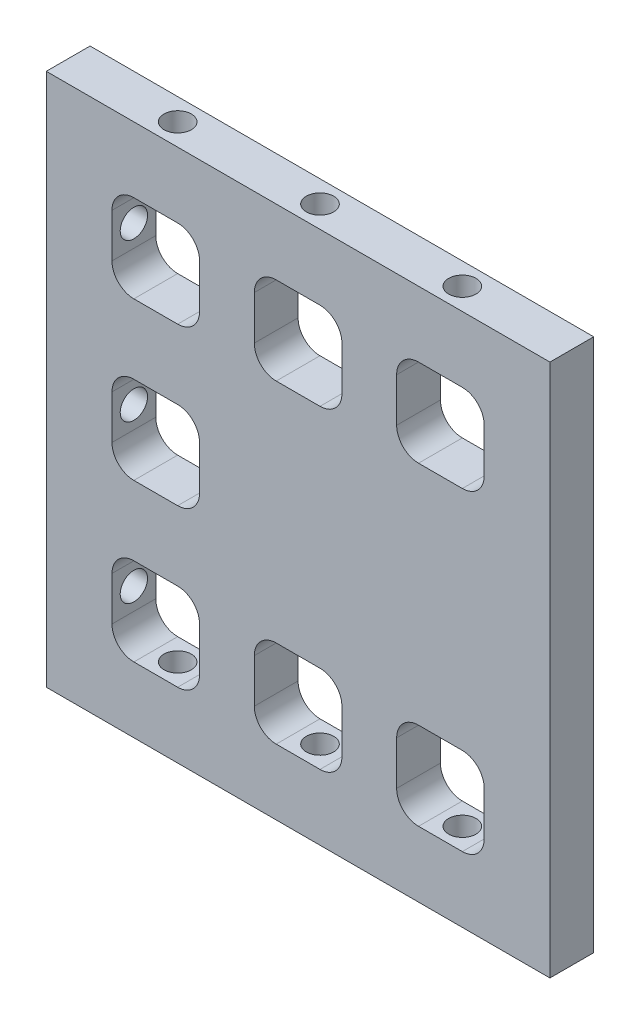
ISO-10303-21;
HEADER;
FILE_DESCRIPTION(('STEP AP214'),'2;1');
FILE_NAME('part.step','',(''),(''),'','','');
FILE_SCHEMA(('AUTOMOTIVE_DESIGN { 1 0 10303 214 1 1 1 1 }'));
ENDSEC;
DATA;
#1=APPLICATION_CONTEXT('core data for automotive mechanical design processes');
#2=APPLICATION_PROTOCOL_DEFINITION('international standard','automotive_design',2000,#1);
#3=PRODUCT_CONTEXT('',#1,'mechanical');
#4=PRODUCT('Part','Part','',(#3));
#5=PRODUCT_RELATED_PRODUCT_CATEGORY('part','',(#4));
#6=PRODUCT_DEFINITION_FORMATION('','',#4);
#7=PRODUCT_DEFINITION_CONTEXT('part definition',#1,'design');
#8=PRODUCT_DEFINITION('design','',#6,#7);
#9=PRODUCT_DEFINITION_SHAPE('','',#8);
#10=(LENGTH_UNIT() NAMED_UNIT(*) SI_UNIT(.MILLI.,.METRE.));
#11=(NAMED_UNIT(*) PLANE_ANGLE_UNIT() SI_UNIT($,.RADIAN.));
#12=(NAMED_UNIT(*) SI_UNIT($,.STERADIAN.) SOLID_ANGLE_UNIT());
#13=UNCERTAINTY_MEASURE_WITH_UNIT(LENGTH_MEASURE(1.E-05),#10,'distance_accuracy_value','');
#14=(GEOMETRIC_REPRESENTATION_CONTEXT(3) GLOBAL_UNCERTAINTY_ASSIGNED_CONTEXT((#13)) GLOBAL_UNIT_ASSIGNED_CONTEXT((#10,
#11,#12)) REPRESENTATION_CONTEXT('',''));
#15=CARTESIAN_POINT('',(0.,0.,0.));
#16=DIRECTION('',(0.,0.,1.));
#17=DIRECTION('',(1.,0.,0.));
#18=AXIS2_PLACEMENT_3D('',#15,#16,#17);
#19=CARTESIAN_POINT('',(-33.02,75.311,6.35));
#20=DIRECTION('',(1.,0.,0.));
#21=DIRECTION('',(0.,0.,-1.));
#22=AXIS2_PLACEMENT_3D('',#19,#20,#21);
#23=PLANE('',#22);
#24=CARTESIAN_POINT('',(-33.02,43.561,0.));
#25=DIRECTION('',(-1.,0.,0.));
#26=DIRECTION('',(0.,-1.,0.));
#27=AXIS2_PLACEMENT_3D('',#24,#25,#26);
#28=CIRCLE('',#27,3.9624);
#29=CARTESIAN_POINT('',(-33.02,39.5985999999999,0.));
#30=VERTEX_POINT('',#29);
#31=EDGE_CURVE('E700',#30,#30,#28,.T.);
#32=ORIENTED_EDGE('',*,*,#31,.F.);
#33=EDGE_LOOP('',(#32));
#34=FACE_BOUND('',#33,.T.);
#35=CARTESIAN_POINT('',(-33.02,-2.03200000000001,0.));
#36=DIRECTION('',(-1.,0.,0.));
#37=DIRECTION('',(0.,-1.,0.));
#38=AXIS2_PLACEMENT_3D('',#35,#36,#37);
#39=CIRCLE('',#38,3.9624);
#40=CARTESIAN_POINT('',(-33.02,-5.99440000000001,0.));
#41=VERTEX_POINT('',#40);
#42=EDGE_CURVE('E704',#41,#41,#39,.T.);
#43=ORIENTED_EDGE('',*,*,#42,.F.);
#44=EDGE_LOOP('',(#43));
#45=FACE_BOUND('',#44,.T.);
#46=CARTESIAN_POINT('',(-33.02,-47.625,0.));
#47=DIRECTION('',(-1.,0.,0.));
#48=DIRECTION('',(0.,-1.,0.));
#49=AXIS2_PLACEMENT_3D('',#46,#47,#48);
#50=CIRCLE('',#49,3.9624);
#51=CARTESIAN_POINT('',(-33.02,-51.5874,0.));
#52=VERTEX_POINT('',#51);
#53=EDGE_CURVE('E708',#52,#52,#50,.T.);
#54=ORIENTED_EDGE('',*,*,#53,.F.);
#55=EDGE_LOOP('',(#54));
#56=FACE_BOUND('',#55,.T.);
#57=DIRECTION('',(0.,0.,-1.));
#58=VECTOR('',#57,1.);
#59=CARTESIAN_POINT('',(-33.02,75.311,6.35));
#60=LINE('',#59,#58);
#61=CARTESIAN_POINT('',(-33.02,75.311,6.35));
#62=VERTEX_POINT('',#61);
#63=CARTESIAN_POINT('',(-33.02,75.311,-6.35));
#64=VERTEX_POINT('',#63);
#65=EDGE_CURVE('E38',#62,#64,#60,.T.);
#66=ORIENTED_EDGE('',*,*,#65,.T.);
#67=DIRECTION('',(0.,-1.,0.));
#68=VECTOR('',#67,1.);
#69=CARTESIAN_POINT('',(-33.02,75.311,-6.35));
#70=LINE('',#69,#68);
#71=CARTESIAN_POINT('',(-33.02,-79.375,-6.35));
#72=VERTEX_POINT('',#71);
#73=EDGE_CURVE('E886',#64,#72,#70,.T.);
#74=ORIENTED_EDGE('',*,*,#73,.T.);
#75=DIRECTION('',(0.,0.,-1.));
#76=VECTOR('',#75,1.);
#77=CARTESIAN_POINT('',(-33.02,-79.375,6.35));
#78=LINE('',#77,#76);
#79=CARTESIAN_POINT('',(-33.02,-79.375,6.35));
#80=VERTEX_POINT('',#79);
#81=EDGE_CURVE('E11',#80,#72,#78,.T.);
#82=ORIENTED_EDGE('',*,*,#81,.F.);
#83=DIRECTION('',(0.,-1.,0.));
#84=VECTOR('',#83,1.);
#85=CARTESIAN_POINT('',(-33.02,75.311,6.35));
#86=LINE('',#85,#84);
#87=EDGE_CURVE('E907',#62,#80,#86,.T.);
#88=ORIENTED_EDGE('',*,*,#87,.F.);
#89=EDGE_LOOP('',(#66,#74,#82,#88));
#90=FACE_BOUND('',#89,.T.);
#91=ADVANCED_FACE('F30',(#34,#45,#56,#90),#23,.F.);
#92=CARTESIAN_POINT('',(-33.02,-79.375,6.35));
#93=DIRECTION('',(0.,1.,0.));
#94=DIRECTION('',(-1.,0.,0.));
#95=AXIS2_PLACEMENT_3D('',#92,#93,#94);
#96=PLANE('',#95);
#97=CARTESIAN_POINT('',(40.005,-79.375,0.));
#98=DIRECTION('',(0.,-1.,0.));
#99=DIRECTION('',(1.,0.,0.));
#100=AXIS2_PLACEMENT_3D('',#97,#98,#99);
#101=CIRCLE('',#100,3.9624);
#102=CARTESIAN_POINT('',(43.9674,-79.375,0.));
#103=VERTEX_POINT('',#102);
#104=EDGE_CURVE('E940',#103,#103,#101,.T.);
#105=ORIENTED_EDGE('',*,*,#104,.F.);
#106=EDGE_LOOP('',(#105));
#107=FACE_BOUND('',#106,.T.);
#108=CARTESIAN_POINT('',(81.28,-79.375,0.));
#109=DIRECTION('',(0.,-1.,0.));
#110=DIRECTION('',(1.,0.,0.));
#111=AXIS2_PLACEMENT_3D('',#108,#109,#110);
#112=CIRCLE('',#111,3.9624);
#113=CARTESIAN_POINT('',(85.2424,-79.375,0.));
#114=VERTEX_POINT('',#113);
#115=EDGE_CURVE('E928',#114,#114,#112,.T.);
#116=ORIENTED_EDGE('',*,*,#115,.F.);
#117=EDGE_LOOP('',(#116));
#118=FACE_BOUND('',#117,.T.);
#119=CARTESIAN_POINT('',(-1.26999999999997,-79.375,0.));
#120=DIRECTION('',(0.,-1.,0.));
#121=DIRECTION('',(1.,0.,0.));
#122=AXIS2_PLACEMENT_3D('',#119,#120,#121);
#123=CIRCLE('',#122,3.9624);
#124=CARTESIAN_POINT('',(2.69240000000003,-79.375,0.));
#125=VERTEX_POINT('',#124);
#126=EDGE_CURVE('E530',#125,#125,#123,.T.);
#127=ORIENTED_EDGE('',*,*,#126,.F.);
#128=EDGE_LOOP('',(#127));
#129=FACE_BOUND('',#128,.T.);
#130=DIRECTION('',(1.,0.,0.));
#131=VECTOR('',#130,1.);
#132=CARTESIAN_POINT('',(-33.02,-79.375,-6.35));
#133=LINE('',#132,#131);
#134=CARTESIAN_POINT('',(113.03,-79.375,-6.34999999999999));
#135=VERTEX_POINT('',#134);
#136=EDGE_CURVE('E903',#72,#135,#133,.T.);
#137=ORIENTED_EDGE('',*,*,#136,.T.);
#138=DIRECTION('',(0.,0.,1.));
#139=VECTOR('',#138,1.);
#140=CARTESIAN_POINT('',(113.03,-79.375,-187.377958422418));
#141=LINE('',#140,#139);
#142=CARTESIAN_POINT('',(113.03,-79.375,6.35));
#143=VERTEX_POINT('',#142);
#144=EDGE_CURVE('E686',#135,#143,#141,.T.);
#145=ORIENTED_EDGE('',*,*,#144,.T.);
#146=DIRECTION('',(1.,0.,0.));
#147=VECTOR('',#146,1.);
#148=CARTESIAN_POINT('',(-33.02,-79.375,6.35));
#149=LINE('',#148,#147);
#150=EDGE_CURVE('E910',#80,#143,#149,.T.);
#151=ORIENTED_EDGE('',*,*,#150,.F.);
#152=ORIENTED_EDGE('',*,*,#81,.T.);
#153=EDGE_LOOP('',(#137,#145,#151,#152));
#154=FACE_BOUND('',#153,.T.);
#155=ADVANCED_FACE('F948',(#107,#118,#129,#154),#96,.F.);
#156=CARTESIAN_POINT('',(-33.02,75.311,6.35));
#157=DIRECTION('',(0.,-1.,0.));
#158=DIRECTION('',(1.,0.,0.));
#159=AXIS2_PLACEMENT_3D('',#156,#157,#158);
#160=PLANE('',#159);
#161=CARTESIAN_POINT('',(40.005,75.311,0.));
#162=DIRECTION('',(0.,1.,0.));
#163=DIRECTION('',(-1.,0.,0.));
#164=AXIS2_PLACEMENT_3D('',#161,#162,#163);
#165=CIRCLE('',#164,3.9624);
#166=CARTESIAN_POINT('',(36.0426,75.311,0.));
#167=VERTEX_POINT('',#166);
#168=EDGE_CURVE('E931',#167,#167,#165,.T.);
#169=ORIENTED_EDGE('',*,*,#168,.F.);
#170=EDGE_LOOP('',(#169));
#171=FACE_BOUND('',#170,.T.);
#172=CARTESIAN_POINT('',(81.28,75.311,0.));
#173=DIRECTION('',(0.,1.,0.));
#174=DIRECTION('',(-1.,0.,0.));
#175=AXIS2_PLACEMENT_3D('',#172,#173,#174);
#176=CIRCLE('',#175,3.9624);
#177=CARTESIAN_POINT('',(77.3176,75.311,0.));
#178=VERTEX_POINT('',#177);
#179=EDGE_CURVE('E438',#178,#178,#176,.T.);
#180=ORIENTED_EDGE('',*,*,#179,.F.);
#181=EDGE_LOOP('',(#180));
#182=FACE_BOUND('',#181,.T.);
#183=CARTESIAN_POINT('',(-1.27,75.311,0.));
#184=DIRECTION('',(0.,1.,0.));
#185=DIRECTION('',(-1.,0.,0.));
#186=AXIS2_PLACEMENT_3D('',#183,#184,#185);
#187=CIRCLE('',#186,3.9624);
#188=CARTESIAN_POINT('',(-5.2324,75.311,0.));
#189=VERTEX_POINT('',#188);
#190=EDGE_CURVE('E696',#189,#189,#187,.T.);
#191=ORIENTED_EDGE('',*,*,#190,.F.);
#192=EDGE_LOOP('',(#191));
#193=FACE_BOUND('',#192,.T.);
#194=ORIENTED_EDGE('',*,*,#65,.F.);
#195=DIRECTION('',(-1.,0.,0.));
#196=VECTOR('',#195,1.);
#197=CARTESIAN_POINT('',(-33.02,75.311,6.35));
#198=LINE('',#197,#196);
#199=CARTESIAN_POINT('',(113.03,75.311,6.35));
#200=VERTEX_POINT('',#199);
#201=EDGE_CURVE('E912',#200,#62,#198,.T.);
#202=ORIENTED_EDGE('',*,*,#201,.F.);
#203=DIRECTION('',(0.,0.,1.));
#204=VECTOR('',#203,1.);
#205=CARTESIAN_POINT('',(113.03,75.311,-187.377958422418));
#206=LINE('',#205,#204);
#207=CARTESIAN_POINT('',(113.03,75.311,-6.34999999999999));
#208=VERTEX_POINT('',#207);
#209=EDGE_CURVE('E685',#208,#200,#206,.T.);
#210=ORIENTED_EDGE('',*,*,#209,.F.);
#211=DIRECTION('',(-1.,0.,0.));
#212=VECTOR('',#211,1.);
#213=CARTESIAN_POINT('',(-33.02,75.311,-6.35));
#214=LINE('',#213,#212);
#215=EDGE_CURVE('E905',#208,#64,#214,.T.);
#216=ORIENTED_EDGE('',*,*,#215,.T.);
#217=EDGE_LOOP('',(#194,#202,#210,#216));
#218=FACE_BOUND('',#217,.T.);
#219=ADVANCED_FACE('F951',(#171,#182,#193,#218),#160,.F.);
#220=CARTESIAN_POINT('',(-33.02,-79.375,6.35));
#221=DIRECTION('',(0.,0.,1.));
#222=DIRECTION('',(1.,0.,0.));
#223=AXIS2_PLACEMENT_3D('',#220,#221,#222);
#224=PLANE('',#223);
#225=DIRECTION('',(0.,-1.,0.));
#226=VECTOR('',#225,1.);
#227=CARTESIAN_POINT('',(27.305,-41.275,6.35));
#228=LINE('',#227,#226);
#229=CARTESIAN_POINT('',(27.305,-41.275,6.35));
#230=VERTEX_POINT('',#229);
#231=CARTESIAN_POINT('',(27.305,-53.975,6.35));
#232=VERTEX_POINT('',#231);
#233=EDGE_CURVE('E425',#230,#232,#228,.T.);
#234=ORIENTED_EDGE('',*,*,#233,.F.);
#235=CARTESIAN_POINT('',(33.655,-41.275,6.35));
#236=DIRECTION('',(0.,0.,1.));
#237=DIRECTION('',(1.,0.,0.));
#238=AXIS2_PLACEMENT_3D('',#235,#236,#237);
#239=CIRCLE('',#238,6.35);
#240=CARTESIAN_POINT('',(33.655,-34.925,6.35));
#241=VERTEX_POINT('',#240);
#242=EDGE_CURVE('E407',#241,#230,#239,.T.);
#243=ORIENTED_EDGE('',*,*,#242,.F.);
#244=DIRECTION('',(-1.,0.,0.));
#245=VECTOR('',#244,1.);
#246=CARTESIAN_POINT('',(33.655,-34.925,6.35));
#247=LINE('',#246,#245);
#248=CARTESIAN_POINT('',(46.355,-34.925,6.35));
#249=VERTEX_POINT('',#248);
#250=EDGE_CURVE('E419',#249,#241,#247,.T.);
#251=ORIENTED_EDGE('',*,*,#250,.F.);
#252=CARTESIAN_POINT('',(46.355,-41.275,6.35));
#253=DIRECTION('',(0.,0.,1.));
#254=DIRECTION('',(-1.,0.,0.));
#255=AXIS2_PLACEMENT_3D('',#252,#253,#254);
#256=CIRCLE('',#255,6.35);
#257=CARTESIAN_POINT('',(52.705,-41.275,6.35));
#258=VERTEX_POINT('',#257);
#259=EDGE_CURVE('E662',#258,#249,#256,.T.);
#260=ORIENTED_EDGE('',*,*,#259,.F.);
#261=DIRECTION('',(0.,1.,0.));
#262=VECTOR('',#261,1.);
#263=CARTESIAN_POINT('',(52.705,-41.275,6.35));
#264=LINE('',#263,#262);
#265=CARTESIAN_POINT('',(52.705,-53.975,6.35));
#266=VERTEX_POINT('',#265);
#267=EDGE_CURVE('E659',#266,#258,#264,.T.);
#268=ORIENTED_EDGE('',*,*,#267,.F.);
#269=CARTESIAN_POINT('',(46.355,-53.975,6.35));
#270=DIRECTION('',(0.,0.,1.));
#271=DIRECTION('',(1.,0.,0.));
#272=AXIS2_PLACEMENT_3D('',#269,#270,#271);
#273=CIRCLE('',#272,6.35);
#274=CARTESIAN_POINT('',(46.355,-60.325,6.35));
#275=VERTEX_POINT('',#274);
#276=EDGE_CURVE('E646',#275,#266,#273,.T.);
#277=ORIENTED_EDGE('',*,*,#276,.F.);
#278=DIRECTION('',(1.,0.,0.));
#279=VECTOR('',#278,1.);
#280=CARTESIAN_POINT('',(33.655,-60.325,6.35));
#281=LINE('',#280,#279);
#282=CARTESIAN_POINT('',(33.655,-60.325,6.35));
#283=VERTEX_POINT('',#282);
#284=EDGE_CURVE('E667',#283,#275,#281,.T.);
#285=ORIENTED_EDGE('',*,*,#284,.F.);
#286=CARTESIAN_POINT('',(33.655,-53.975,6.35));
#287=DIRECTION('',(0.,0.,1.));
#288=DIRECTION('',(1.,0.,0.));
#289=AXIS2_PLACEMENT_3D('',#286,#287,#288);
#290=CIRCLE('',#289,6.35);
#291=EDGE_CURVE('E418',#232,#283,#290,.T.);
#292=ORIENTED_EDGE('',*,*,#291,.F.);
#293=EDGE_LOOP('',(#234,#243,#251,#260,#268,#277,#285,#292));
#294=FACE_BOUND('',#293,.T.);
#295=DIRECTION('',(0.,-1.,0.));
#296=VECTOR('',#295,1.);
#297=CARTESIAN_POINT('',(27.305,49.911,6.35));
#298=LINE('',#297,#296);
#299=CARTESIAN_POINT('',(27.305,49.911,6.35));
#300=VERTEX_POINT('',#299);
#301=CARTESIAN_POINT('',(27.305,37.211,6.35));
#302=VERTEX_POINT('',#301);
#303=EDGE_CURVE('E443',#300,#302,#298,.T.);
#304=ORIENTED_EDGE('',*,*,#303,.F.);
#305=CARTESIAN_POINT('',(33.655,49.911,6.35));
#306=DIRECTION('',(0.,0.,1.));
#307=DIRECTION('',(-1.,0.,0.));
#308=AXIS2_PLACEMENT_3D('',#305,#306,#307);
#309=CIRCLE('',#308,6.35);
#310=CARTESIAN_POINT('',(33.655,56.261,6.35));
#311=VERTEX_POINT('',#310);
#312=EDGE_CURVE('E641',#311,#300,#309,.T.);
#313=ORIENTED_EDGE('',*,*,#312,.F.);
#314=DIRECTION('',(-1.,0.,0.));
#315=VECTOR('',#314,1.);
#316=CARTESIAN_POINT('',(33.655,56.261,6.35));
#317=LINE('',#316,#315);
#318=CARTESIAN_POINT('',(46.355,56.261,6.35));
#319=VERTEX_POINT('',#318);
#320=EDGE_CURVE('E638',#319,#311,#317,.T.);
#321=ORIENTED_EDGE('',*,*,#320,.F.);
#322=CARTESIAN_POINT('',(46.355,49.911,6.35));
#323=DIRECTION('',(0.,0.,1.));
#324=DIRECTION('',(-1.,0.,0.));
#325=AXIS2_PLACEMENT_3D('',#322,#323,#324);
#326=CIRCLE('',#325,6.35);
#327=CARTESIAN_POINT('',(52.705,49.911,6.35));
#328=VERTEX_POINT('',#327);
#329=EDGE_CURVE('E635',#328,#319,#326,.T.);
#330=ORIENTED_EDGE('',*,*,#329,.F.);
#331=DIRECTION('',(0.,1.,0.));
#332=VECTOR('',#331,1.);
#333=CARTESIAN_POINT('',(52.705,49.911,6.35));
#334=LINE('',#333,#332);
#335=CARTESIAN_POINT('',(52.705,37.211,6.35));
#336=VERTEX_POINT('',#335);
#337=EDGE_CURVE('E632',#336,#328,#334,.T.);
#338=ORIENTED_EDGE('',*,*,#337,.F.);
#339=CARTESIAN_POINT('',(46.355,37.211,6.35));
#340=DIRECTION('',(0.,0.,1.));
#341=DIRECTION('',(-1.,0.,0.));
#342=AXIS2_PLACEMENT_3D('',#339,#340,#341);
#343=CIRCLE('',#342,6.35);
#344=CARTESIAN_POINT('',(46.355,30.861,6.35));
#345=VERTEX_POINT('',#344);
#346=EDGE_CURVE('E629',#345,#336,#343,.T.);
#347=ORIENTED_EDGE('',*,*,#346,.F.);
#348=DIRECTION('',(1.,0.,0.));
#349=VECTOR('',#348,1.);
#350=CARTESIAN_POINT('',(33.655,30.861,6.35));
#351=LINE('',#350,#349);
#352=CARTESIAN_POINT('',(33.655,30.861,6.35));
#353=VERTEX_POINT('',#352);
#354=EDGE_CURVE('E626',#353,#345,#351,.T.);
#355=ORIENTED_EDGE('',*,*,#354,.F.);
#356=CARTESIAN_POINT('',(33.655,37.211,6.35));
#357=DIRECTION('',(0.,0.,1.));
#358=DIRECTION('',(1.,0.,0.));
#359=AXIS2_PLACEMENT_3D('',#356,#357,#358);
#360=CIRCLE('',#359,6.35);
#361=EDGE_CURVE('E611',#302,#353,#360,.T.);
#362=ORIENTED_EDGE('',*,*,#361,.F.);
#363=EDGE_LOOP('',(#304,#313,#321,#330,#338,#347,#355,#362));
#364=FACE_BOUND('',#363,.T.);
#365=ORIENTED_EDGE('',*,*,#150,.T.);
#366=DIRECTION('',(0.,1.,0.));
#367=VECTOR('',#366,1.);
#368=CARTESIAN_POINT('',(113.03,75.311,6.35));
#369=LINE('',#368,#367);
#370=EDGE_CURVE('E673',#143,#200,#369,.T.);
#371=ORIENTED_EDGE('',*,*,#370,.T.);
#372=ORIENTED_EDGE('',*,*,#201,.T.);
#373=ORIENTED_EDGE('',*,*,#87,.T.);
#374=EDGE_LOOP('',(#365,#371,#372,#373));
#375=FACE_BOUND('',#374,.T.);
#376=CARTESIAN_POINT('',(5.07999999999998,-41.275,6.35));
#377=DIRECTION('',(0.,0.,1.));
#378=DIRECTION('',(-1.,0.,0.));
#379=AXIS2_PLACEMENT_3D('',#376,#377,#378);
#380=CIRCLE('',#379,6.35);
#381=CARTESIAN_POINT('',(11.43,-41.275,6.35));
#382=VERTEX_POINT('',#381);
#383=CARTESIAN_POINT('',(5.07999999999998,-34.925,6.35));
#384=VERTEX_POINT('',#383);
#385=EDGE_CURVE('E46',#382,#384,#380,.T.);
#386=ORIENTED_EDGE('',*,*,#385,.F.);
#387=DIRECTION('',(0.,1.,0.));
#388=VECTOR('',#387,1.);
#389=CARTESIAN_POINT('',(11.43,-41.275,6.35));
#390=LINE('',#389,#388);
#391=CARTESIAN_POINT('',(11.43,-53.975,6.35));
#392=VERTEX_POINT('',#391);
#393=EDGE_CURVE('E731',#392,#382,#390,.T.);
#394=ORIENTED_EDGE('',*,*,#393,.F.);
#395=CARTESIAN_POINT('',(5.07999999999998,-53.975,6.35));
#396=DIRECTION('',(0.,0.,1.));
#397=DIRECTION('',(1.,0.,0.));
#398=AXIS2_PLACEMENT_3D('',#395,#396,#397);
#399=CIRCLE('',#398,6.35);
#400=CARTESIAN_POINT('',(5.07999999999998,-60.325,6.35));
#401=VERTEX_POINT('',#400);
#402=EDGE_CURVE('E728',#401,#392,#399,.T.);
#403=ORIENTED_EDGE('',*,*,#402,.F.);
#404=DIRECTION('',(1.,0.,0.));
#405=VECTOR('',#404,1.);
#406=CARTESIAN_POINT('',(-7.62000000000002,-60.325,6.35));
#407=LINE('',#406,#405);
#408=CARTESIAN_POINT('',(-7.62000000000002,-60.325,6.35));
#409=VERTEX_POINT('',#408);
#410=EDGE_CURVE('E725',#409,#401,#407,.T.);
#411=ORIENTED_EDGE('',*,*,#410,.F.);
#412=CARTESIAN_POINT('',(-7.62000000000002,-53.975,6.35));
#413=DIRECTION('',(0.,0.,1.));
#414=DIRECTION('',(1.,0.,0.));
#415=AXIS2_PLACEMENT_3D('',#412,#413,#414);
#416=CIRCLE('',#415,6.35);
#417=CARTESIAN_POINT('',(-13.97,-53.975,6.35));
#418=VERTEX_POINT('',#417);
#419=EDGE_CURVE('E722',#418,#409,#416,.T.);
#420=ORIENTED_EDGE('',*,*,#419,.F.);
#421=DIRECTION('',(0.,-1.,0.));
#422=VECTOR('',#421,1.);
#423=CARTESIAN_POINT('',(-13.97,-41.275,6.35));
#424=LINE('',#423,#422);
#425=CARTESIAN_POINT('',(-13.97,-41.275,6.35));
#426=VERTEX_POINT('',#425);
#427=EDGE_CURVE('E719',#426,#418,#424,.T.);
#428=ORIENTED_EDGE('',*,*,#427,.F.);
#429=CARTESIAN_POINT('',(-7.62000000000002,-41.275,6.35));
#430=DIRECTION('',(0.,0.,1.));
#431=DIRECTION('',(1.,0.,0.));
#432=AXIS2_PLACEMENT_3D('',#429,#430,#431);
#433=CIRCLE('',#432,6.35);
#434=CARTESIAN_POINT('',(-7.62000000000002,-34.925,6.35));
#435=VERTEX_POINT('',#434);
#436=EDGE_CURVE('E716',#435,#426,#433,.T.);
#437=ORIENTED_EDGE('',*,*,#436,.F.);
#438=DIRECTION('',(-1.,0.,0.));
#439=VECTOR('',#438,1.);
#440=CARTESIAN_POINT('',(-7.62000000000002,-34.925,6.35));
#441=LINE('',#440,#439);
#442=EDGE_CURVE('E713',#384,#435,#441,.T.);
#443=ORIENTED_EDGE('',*,*,#442,.F.);
#444=EDGE_LOOP('',(#386,#394,#403,#411,#420,#428,#437,#443));
#445=FACE_BOUND('',#444,.T.);
#446=CARTESIAN_POINT('',(5.07999999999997,37.211,6.35));
#447=DIRECTION('',(0.,0.,1.));
#448=DIRECTION('',(1.,0.,0.));
#449=AXIS2_PLACEMENT_3D('',#446,#447,#448);
#450=CIRCLE('',#449,6.35);
#451=CARTESIAN_POINT('',(5.07999999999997,30.861,6.35));
#452=VERTEX_POINT('',#451);
#453=CARTESIAN_POINT('',(11.43,37.211,6.35));
#454=VERTEX_POINT('',#453);
#455=EDGE_CURVE('E759',#452,#454,#450,.T.);
#456=ORIENTED_EDGE('',*,*,#455,.F.);
#457=DIRECTION('',(1.,0.,0.));
#458=VECTOR('',#457,1.);
#459=CARTESIAN_POINT('',(-7.62000000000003,30.861,6.35));
#460=LINE('',#459,#458);
#461=CARTESIAN_POINT('',(-7.62000000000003,30.861,6.35));
#462=VERTEX_POINT('',#461);
#463=EDGE_CURVE('E792',#462,#452,#460,.T.);
#464=ORIENTED_EDGE('',*,*,#463,.F.);
#465=CARTESIAN_POINT('',(-7.62000000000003,37.211,6.35));
#466=DIRECTION('',(0.,0.,1.));
#467=DIRECTION('',(-1.,0.,0.));
#468=AXIS2_PLACEMENT_3D('',#465,#466,#467);
#469=CIRCLE('',#468,6.35);
#470=CARTESIAN_POINT('',(-13.97,37.211,6.35));
#471=VERTEX_POINT('',#470);
#472=EDGE_CURVE('E789',#471,#462,#469,.T.);
#473=ORIENTED_EDGE('',*,*,#472,.F.);
#474=DIRECTION('',(0.,-1.,0.));
#475=VECTOR('',#474,1.);
#476=CARTESIAN_POINT('',(-13.97,49.911,6.35));
#477=LINE('',#476,#475);
#478=CARTESIAN_POINT('',(-13.97,49.911,6.35));
#479=VERTEX_POINT('',#478);
#480=EDGE_CURVE('E786',#479,#471,#477,.T.);
#481=ORIENTED_EDGE('',*,*,#480,.F.);
#482=CARTESIAN_POINT('',(-7.62000000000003,49.911,6.35));
#483=DIRECTION('',(0.,0.,1.));
#484=DIRECTION('',(1.,0.,0.));
#485=AXIS2_PLACEMENT_3D('',#482,#483,#484);
#486=CIRCLE('',#485,6.35);
#487=CARTESIAN_POINT('',(-7.62000000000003,56.261,6.35));
#488=VERTEX_POINT('',#487);
#489=EDGE_CURVE('E783',#488,#479,#486,.T.);
#490=ORIENTED_EDGE('',*,*,#489,.F.);
#491=DIRECTION('',(-1.,0.,0.));
#492=VECTOR('',#491,1.);
#493=CARTESIAN_POINT('',(-7.62000000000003,56.261,6.35));
#494=LINE('',#493,#492);
#495=CARTESIAN_POINT('',(5.07999999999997,56.261,6.35));
#496=VERTEX_POINT('',#495);
#497=EDGE_CURVE('E780',#496,#488,#494,.T.);
#498=ORIENTED_EDGE('',*,*,#497,.F.);
#499=CARTESIAN_POINT('',(5.07999999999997,49.911,6.35));
#500=DIRECTION('',(0.,0.,1.));
#501=DIRECTION('',(-1.,0.,0.));
#502=AXIS2_PLACEMENT_3D('',#499,#500,#501);
#503=CIRCLE('',#502,6.35);
#504=CARTESIAN_POINT('',(11.43,49.911,6.35));
#505=VERTEX_POINT('',#504);
#506=EDGE_CURVE('E777',#505,#496,#503,.T.);
#507=ORIENTED_EDGE('',*,*,#506,.F.);
#508=DIRECTION('',(0.,1.,0.));
#509=VECTOR('',#508,1.);
#510=CARTESIAN_POINT('',(11.43,49.911,6.35));
#511=LINE('',#510,#509);
#512=EDGE_CURVE('E774',#454,#505,#511,.T.);
#513=ORIENTED_EDGE('',*,*,#512,.F.);
#514=EDGE_LOOP('',(#456,#464,#473,#481,#490,#498,#507,#513));
#515=FACE_BOUND('',#514,.T.);
#516=CARTESIAN_POINT('',(5.07999999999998,-8.382,6.35));
#517=DIRECTION('',(0.,0.,1.));
#518=DIRECTION('',(1.,0.,0.));
#519=AXIS2_PLACEMENT_3D('',#516,#517,#518);
#520=CIRCLE('',#519,6.35);
#521=CARTESIAN_POINT('',(5.07999999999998,-14.732,6.35));
#522=VERTEX_POINT('',#521);
#523=CARTESIAN_POINT('',(11.43,-8.382,6.35));
#524=VERTEX_POINT('',#523);
#525=EDGE_CURVE('E822',#522,#524,#520,.T.);
#526=ORIENTED_EDGE('',*,*,#525,.F.);
#527=DIRECTION('',(1.,0.,0.));
#528=VECTOR('',#527,1.);
#529=CARTESIAN_POINT('',(-7.62000000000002,-14.732,6.35));
#530=LINE('',#529,#528);
#531=CARTESIAN_POINT('',(-7.62000000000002,-14.732,6.35));
#532=VERTEX_POINT('',#531);
#533=EDGE_CURVE('E856',#532,#522,#530,.T.);
#534=ORIENTED_EDGE('',*,*,#533,.F.);
#535=CARTESIAN_POINT('',(-7.62000000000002,-8.382,6.35));
#536=DIRECTION('',(0.,0.,1.));
#537=DIRECTION('',(-1.,0.,0.));
#538=AXIS2_PLACEMENT_3D('',#535,#536,#537);
#539=CIRCLE('',#538,6.35);
#540=CARTESIAN_POINT('',(-13.97,-8.382,6.35));
#541=VERTEX_POINT('',#540);
#542=EDGE_CURVE('E853',#541,#532,#539,.T.);
#543=ORIENTED_EDGE('',*,*,#542,.F.);
#544=DIRECTION('',(0.,-1.,0.));
#545=VECTOR('',#544,1.);
#546=CARTESIAN_POINT('',(-13.97,4.318,6.35));
#547=LINE('',#546,#545);
#548=CARTESIAN_POINT('',(-13.97,4.318,6.35));
#549=VERTEX_POINT('',#548);
#550=EDGE_CURVE('E850',#549,#541,#547,.T.);
#551=ORIENTED_EDGE('',*,*,#550,.F.);
#552=CARTESIAN_POINT('',(-7.62000000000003,4.318,6.35));
#553=DIRECTION('',(0.,0.,1.));
#554=DIRECTION('',(1.,0.,0.));
#555=AXIS2_PLACEMENT_3D('',#552,#553,#554);
#556=CIRCLE('',#555,6.35);
#557=CARTESIAN_POINT('',(-7.62000000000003,10.668,6.35));
#558=VERTEX_POINT('',#557);
#559=EDGE_CURVE('E847',#558,#549,#556,.T.);
#560=ORIENTED_EDGE('',*,*,#559,.F.);
#561=DIRECTION('',(-1.,0.,0.));
#562=VECTOR('',#561,1.);
#563=CARTESIAN_POINT('',(-7.62000000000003,10.668,6.35));
#564=LINE('',#563,#562);
#565=CARTESIAN_POINT('',(5.07999999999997,10.668,6.35));
#566=VERTEX_POINT('',#565);
#567=EDGE_CURVE('E844',#566,#558,#564,.T.);
#568=ORIENTED_EDGE('',*,*,#567,.F.);
#569=CARTESIAN_POINT('',(5.07999999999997,4.318,6.35));
#570=DIRECTION('',(0.,0.,1.));
#571=DIRECTION('',(-1.,0.,0.));
#572=AXIS2_PLACEMENT_3D('',#569,#570,#571);
#573=CIRCLE('',#572,6.35);
#574=CARTESIAN_POINT('',(11.43,4.318,6.35));
#575=VERTEX_POINT('',#574);
#576=EDGE_CURVE('E841',#575,#566,#573,.T.);
#577=ORIENTED_EDGE('',*,*,#576,.F.);
#578=DIRECTION('',(0.,1.,0.));
#579=VECTOR('',#578,1.);
#580=CARTESIAN_POINT('',(11.43,4.318,6.35));
#581=LINE('',#580,#579);
#582=EDGE_CURVE('E838',#524,#575,#581,.T.);
#583=ORIENTED_EDGE('',*,*,#582,.F.);
#584=EDGE_LOOP('',(#526,#534,#543,#551,#560,#568,#577,#583));
#585=FACE_BOUND('',#584,.T.);
#586=CARTESIAN_POINT('',(87.63,-53.975,6.35));
#587=DIRECTION('',(0.,0.,1.));
#588=DIRECTION('',(1.,0.,0.));
#589=AXIS2_PLACEMENT_3D('',#586,#587,#588);
#590=CIRCLE('',#589,6.35);
#591=CARTESIAN_POINT('',(87.63,-60.325,6.35));
#592=VERTEX_POINT('',#591);
#593=CARTESIAN_POINT('',(93.98,-53.975,6.35));
#594=VERTEX_POINT('',#593);
#595=EDGE_CURVE('E571',#592,#594,#590,.T.);
#596=ORIENTED_EDGE('',*,*,#595,.F.);
#597=DIRECTION('',(1.,0.,0.));
#598=VECTOR('',#597,1.);
#599=CARTESIAN_POINT('',(74.93,-60.325,6.35));
#600=LINE('',#599,#598);
#601=CARTESIAN_POINT('',(74.93,-60.325,6.35));
#602=VERTEX_POINT('',#601);
#603=EDGE_CURVE('E605',#602,#592,#600,.T.);
#604=ORIENTED_EDGE('',*,*,#603,.F.);
#605=CARTESIAN_POINT('',(74.93,-53.975,6.35));
#606=DIRECTION('',(0.,0.,1.));
#607=DIRECTION('',(1.,0.,0.));
#608=AXIS2_PLACEMENT_3D('',#605,#606,#607);
#609=CIRCLE('',#608,6.35);
#610=CARTESIAN_POINT('',(68.58,-53.975,6.35));
#611=VERTEX_POINT('',#610);
#612=EDGE_CURVE('E602',#611,#602,#609,.T.);
#613=ORIENTED_EDGE('',*,*,#612,.F.);
#614=DIRECTION('',(0.,-1.,0.));
#615=VECTOR('',#614,1.);
#616=CARTESIAN_POINT('',(68.58,-41.275,6.35));
#617=LINE('',#616,#615);
#618=CARTESIAN_POINT('',(68.58,-41.275,6.35));
#619=VERTEX_POINT('',#618);
#620=EDGE_CURVE('E599',#619,#611,#617,.T.);
#621=ORIENTED_EDGE('',*,*,#620,.F.);
#622=CARTESIAN_POINT('',(74.93,-41.275,6.35));
#623=DIRECTION('',(0.,0.,1.));
#624=DIRECTION('',(1.,0.,0.));
#625=AXIS2_PLACEMENT_3D('',#622,#623,#624);
#626=CIRCLE('',#625,6.35);
#627=CARTESIAN_POINT('',(74.93,-34.925,6.35));
#628=VERTEX_POINT('',#627);
#629=EDGE_CURVE('E596',#628,#619,#626,.T.);
#630=ORIENTED_EDGE('',*,*,#629,.F.);
#631=DIRECTION('',(-1.,0.,0.));
#632=VECTOR('',#631,1.);
#633=CARTESIAN_POINT('',(74.93,-34.925,6.35));
#634=LINE('',#633,#632);
#635=CARTESIAN_POINT('',(87.63,-34.925,6.35));
#636=VERTEX_POINT('',#635);
#637=EDGE_CURVE('E593',#636,#628,#634,.T.);
#638=ORIENTED_EDGE('',*,*,#637,.F.);
#639=CARTESIAN_POINT('',(87.63,-41.275,6.35));
#640=DIRECTION('',(0.,0.,1.));
#641=DIRECTION('',(-1.,0.,0.));
#642=AXIS2_PLACEMENT_3D('',#639,#640,#641);
#643=CIRCLE('',#642,6.34999999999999);
#644=CARTESIAN_POINT('',(93.98,-41.275,6.35));
#645=VERTEX_POINT('',#644);
#646=EDGE_CURVE('E590',#645,#636,#643,.T.);
#647=ORIENTED_EDGE('',*,*,#646,.F.);
#648=DIRECTION('',(0.,1.,0.));
#649=VECTOR('',#648,1.);
#650=CARTESIAN_POINT('',(93.98,-41.275,6.35));
#651=LINE('',#650,#649);
#652=EDGE_CURVE('E587',#594,#645,#651,.T.);
#653=ORIENTED_EDGE('',*,*,#652,.F.);
#654=EDGE_LOOP('',(#596,#604,#613,#621,#630,#638,#647,#653));
#655=FACE_BOUND('',#654,.T.);
#656=CARTESIAN_POINT('',(74.93,37.211,6.35));
#657=DIRECTION('',(0.,0.,1.));
#658=DIRECTION('',(1.,0.,0.));
#659=AXIS2_PLACEMENT_3D('',#656,#657,#658);
#660=CIRCLE('',#659,6.34999999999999);
#661=CARTESIAN_POINT('',(68.58,37.211,6.35));
#662=VERTEX_POINT('',#661);
#663=CARTESIAN_POINT('',(74.93,30.861,6.35));
#664=VERTEX_POINT('',#663);
#665=EDGE_CURVE('E454',#662,#664,#660,.T.);
#666=ORIENTED_EDGE('',*,*,#665,.F.);
#667=DIRECTION('',(0.,-1.,0.));
#668=VECTOR('',#667,1.);
#669=CARTESIAN_POINT('',(68.58,49.911,6.35));
#670=LINE('',#669,#668);
#671=CARTESIAN_POINT('',(68.58,49.911,6.35));
#672=VERTEX_POINT('',#671);
#673=EDGE_CURVE('E565',#672,#662,#670,.T.);
#674=ORIENTED_EDGE('',*,*,#673,.F.);
#675=CARTESIAN_POINT('',(74.93,49.911,6.35));
#676=DIRECTION('',(0.,0.,1.));
#677=DIRECTION('',(-1.,0.,0.));
#678=AXIS2_PLACEMENT_3D('',#675,#676,#677);
#679=CIRCLE('',#678,6.34999999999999);
#680=CARTESIAN_POINT('',(74.93,56.261,6.35));
#681=VERTEX_POINT('',#680);
#682=EDGE_CURVE('E562',#681,#672,#679,.T.);
#683=ORIENTED_EDGE('',*,*,#682,.F.);
#684=DIRECTION('',(-1.,0.,0.));
#685=VECTOR('',#684,1.);
#686=CARTESIAN_POINT('',(74.93,56.261,6.35));
#687=LINE('',#686,#685);
#688=CARTESIAN_POINT('',(87.63,56.261,6.35));
#689=VERTEX_POINT('',#688);
#690=EDGE_CURVE('E559',#689,#681,#687,.T.);
#691=ORIENTED_EDGE('',*,*,#690,.F.);
#692=CARTESIAN_POINT('',(87.63,49.911,6.35));
#693=DIRECTION('',(0.,0.,1.));
#694=DIRECTION('',(-1.,0.,0.));
#695=AXIS2_PLACEMENT_3D('',#692,#693,#694);
#696=CIRCLE('',#695,6.35);
#697=CARTESIAN_POINT('',(93.98,49.911,6.35));
#698=VERTEX_POINT('',#697);
#699=EDGE_CURVE('E556',#698,#689,#696,.T.);
#700=ORIENTED_EDGE('',*,*,#699,.F.);
#701=DIRECTION('',(0.,1.,0.));
#702=VECTOR('',#701,1.);
#703=CARTESIAN_POINT('',(93.98,49.911,6.35));
#704=LINE('',#703,#702);
#705=CARTESIAN_POINT('',(93.98,37.211,6.35));
#706=VERTEX_POINT('',#705);
#707=EDGE_CURVE('E553',#706,#698,#704,.T.);
#708=ORIENTED_EDGE('',*,*,#707,.F.);
#709=CARTESIAN_POINT('',(87.63,37.211,6.35));
#710=DIRECTION('',(0.,0.,1.));
#711=DIRECTION('',(-1.,0.,0.));
#712=AXIS2_PLACEMENT_3D('',#709,#710,#711);
#713=CIRCLE('',#712,6.35);
#714=CARTESIAN_POINT('',(87.63,30.861,6.35));
#715=VERTEX_POINT('',#714);
#716=EDGE_CURVE('E550',#715,#706,#713,.T.);
#717=ORIENTED_EDGE('',*,*,#716,.F.);
#718=DIRECTION('',(1.,0.,0.));
#719=VECTOR('',#718,1.);
#720=CARTESIAN_POINT('',(74.93,30.861,6.35));
#721=LINE('',#720,#719);
#722=EDGE_CURVE('E547',#664,#715,#721,.T.);
#723=ORIENTED_EDGE('',*,*,#722,.F.);
#724=EDGE_LOOP('',(#666,#674,#683,#691,#700,#708,#717,#723));
#725=FACE_BOUND('',#724,.T.);
#726=ADVANCED_FACE('F430',(#294,#364,#375,#445,#515,#585,#655,#725),#224,.T.);
#727=CARTESIAN_POINT('',(-33.02,-79.375,-6.35));
#728=DIRECTION('',(0.,0.,1.));
#729=DIRECTION('',(1.,0.,0.));
#730=AXIS2_PLACEMENT_3D('',#727,#728,#729);
#731=PLANE('',#730);
#732=CARTESIAN_POINT('',(33.655,-41.275,-6.34999999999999));
#733=DIRECTION('',(0.,0.,1.));
#734=DIRECTION('',(1.,0.,0.));
#735=AXIS2_PLACEMENT_3D('',#732,#733,#734);
#736=CIRCLE('',#735,6.35);
#737=CARTESIAN_POINT('',(27.305,-41.275,-6.35));
#738=VERTEX_POINT('',#737);
#739=CARTESIAN_POINT('',(33.655,-34.925,-6.34999999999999));
#740=VERTEX_POINT('',#739);
#741=EDGE_CURVE('E534',#738,#740,#736,.F.);
#742=ORIENTED_EDGE('',*,*,#741,.F.);
#743=DIRECTION('',(0.,-1.,0.));
#744=VECTOR('',#743,1.);
#745=CARTESIAN_POINT('',(27.305,-41.275,-6.35));
#746=LINE('',#745,#744);
#747=CARTESIAN_POINT('',(27.305,-53.975,-6.35));
#748=VERTEX_POINT('',#747);
#749=EDGE_CURVE('E427',#738,#748,#746,.T.);
#750=ORIENTED_EDGE('',*,*,#749,.T.);
#751=CARTESIAN_POINT('',(33.655,-53.975,-6.34999999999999));
#752=DIRECTION('',(0.,0.,1.));
#753=DIRECTION('',(1.,0.,0.));
#754=AXIS2_PLACEMENT_3D('',#751,#752,#753);
#755=CIRCLE('',#754,6.35);
#756=CARTESIAN_POINT('',(33.655,-60.325,-6.34999999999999));
#757=VERTEX_POINT('',#756);
#758=EDGE_CURVE('E536',#757,#748,#755,.F.);
#759=ORIENTED_EDGE('',*,*,#758,.F.);
#760=DIRECTION('',(-1.,0.,0.));
#761=VECTOR('',#760,1.);
#762=CARTESIAN_POINT('',(33.655,-60.325,-6.34999999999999));
#763=LINE('',#762,#761);
#764=CARTESIAN_POINT('',(46.355,-60.325,-6.34999999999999));
#765=VERTEX_POINT('',#764);
#766=EDGE_CURVE('E538',#765,#757,#763,.T.);
#767=ORIENTED_EDGE('',*,*,#766,.F.);
#768=CARTESIAN_POINT('',(46.355,-53.975,-6.34999999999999));
#769=DIRECTION('',(0.,0.,1.));
#770=DIRECTION('',(1.,0.,0.));
#771=AXIS2_PLACEMENT_3D('',#768,#769,#770);
#772=CIRCLE('',#771,6.35);
#773=CARTESIAN_POINT('',(52.705,-53.975,-6.34999999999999));
#774=VERTEX_POINT('',#773);
#775=EDGE_CURVE('E512',#774,#765,#772,.F.);
#776=ORIENTED_EDGE('',*,*,#775,.F.);
#777=DIRECTION('',(0.,-1.,0.));
#778=VECTOR('',#777,1.);
#779=CARTESIAN_POINT('',(52.705,-41.275,-6.34999999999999));
#780=LINE('',#779,#778);
#781=CARTESIAN_POINT('',(52.705,-41.275,-6.34999999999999));
#782=VERTEX_POINT('',#781);
#783=EDGE_CURVE('E508',#782,#774,#780,.T.);
#784=ORIENTED_EDGE('',*,*,#783,.F.);
#785=CARTESIAN_POINT('',(46.355,-41.275,-6.34999999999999));
#786=DIRECTION('',(0.,0.,1.));
#787=DIRECTION('',(1.,0.,0.));
#788=AXIS2_PLACEMENT_3D('',#785,#786,#787);
#789=CIRCLE('',#788,6.35);
#790=CARTESIAN_POINT('',(46.355,-34.925,-6.34999999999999));
#791=VERTEX_POINT('',#790);
#792=EDGE_CURVE('E527',#791,#782,#789,.F.);
#793=ORIENTED_EDGE('',*,*,#792,.F.);
#794=DIRECTION('',(1.,0.,0.));
#795=VECTOR('',#794,1.);
#796=CARTESIAN_POINT('',(33.655,-34.925,-6.34999999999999));
#797=LINE('',#796,#795);
#798=EDGE_CURVE('E531',#740,#791,#797,.T.);
#799=ORIENTED_EDGE('',*,*,#798,.F.);
#800=EDGE_LOOP('',(#742,#750,#759,#767,#776,#784,#793,#799));
#801=FACE_BOUND('',#800,.T.);
#802=CARTESIAN_POINT('',(33.655,49.911,-6.34999999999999));
#803=DIRECTION('',(0.,0.,1.));
#804=DIRECTION('',(1.,0.,0.));
#805=AXIS2_PLACEMENT_3D('',#802,#803,#804);
#806=CIRCLE('',#805,6.35);
#807=CARTESIAN_POINT('',(27.305,49.911,-6.35));
#808=VERTEX_POINT('',#807);
#809=CARTESIAN_POINT('',(33.655,56.261,-6.34999999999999));
#810=VERTEX_POINT('',#809);
#811=EDGE_CURVE('E522',#808,#810,#806,.F.);
#812=ORIENTED_EDGE('',*,*,#811,.F.);
#813=DIRECTION('',(0.,-1.,0.));
#814=VECTOR('',#813,1.);
#815=CARTESIAN_POINT('',(27.305,49.911,-6.35));
#816=LINE('',#815,#814);
#817=CARTESIAN_POINT('',(27.305,37.211,-6.35));
#818=VERTEX_POINT('',#817);
#819=EDGE_CURVE('E447',#808,#818,#816,.T.);
#820=ORIENTED_EDGE('',*,*,#819,.T.);
#821=CARTESIAN_POINT('',(33.655,37.211,-6.34999999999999));
#822=DIRECTION('',(0.,0.,1.));
#823=DIRECTION('',(1.,0.,0.));
#824=AXIS2_PLACEMENT_3D('',#821,#822,#823);
#825=CIRCLE('',#824,6.35);
#826=CARTESIAN_POINT('',(33.655,30.861,-6.34999999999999));
#827=VERTEX_POINT('',#826);
#828=EDGE_CURVE('E488',#827,#818,#825,.F.);
#829=ORIENTED_EDGE('',*,*,#828,.F.);
#830=DIRECTION('',(-1.,0.,0.));
#831=VECTOR('',#830,1.);
#832=CARTESIAN_POINT('',(33.655,30.861,-6.34999999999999));
#833=LINE('',#832,#831);
#834=CARTESIAN_POINT('',(46.355,30.861,-6.34999999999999));
#835=VERTEX_POINT('',#834);
#836=EDGE_CURVE('E483',#835,#827,#833,.T.);
#837=ORIENTED_EDGE('',*,*,#836,.F.);
#838=CARTESIAN_POINT('',(46.355,37.211,-6.34999999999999));
#839=DIRECTION('',(0.,0.,1.));
#840=DIRECTION('',(1.,0.,0.));
#841=AXIS2_PLACEMENT_3D('',#838,#839,#840);
#842=CIRCLE('',#841,6.35);
#843=CARTESIAN_POINT('',(52.705,37.211,-6.34999999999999));
#844=VERTEX_POINT('',#843);
#845=EDGE_CURVE('E509',#844,#835,#842,.F.);
#846=ORIENTED_EDGE('',*,*,#845,.F.);
#847=DIRECTION('',(0.,-1.,0.));
#848=VECTOR('',#847,1.);
#849=CARTESIAN_POINT('',(52.705,49.911,-6.34999999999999));
#850=LINE('',#849,#848);
#851=CARTESIAN_POINT('',(52.705,49.911,-6.34999999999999));
#852=VERTEX_POINT('',#851);
#853=EDGE_CURVE('E513',#852,#844,#850,.T.);
#854=ORIENTED_EDGE('',*,*,#853,.F.);
#855=CARTESIAN_POINT('',(46.355,49.911,-6.34999999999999));
#856=DIRECTION('',(0.,0.,1.));
#857=DIRECTION('',(1.,0.,0.));
#858=AXIS2_PLACEMENT_3D('',#855,#856,#857);
#859=CIRCLE('',#858,6.35);
#860=CARTESIAN_POINT('',(46.355,56.261,-6.34999999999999));
#861=VERTEX_POINT('',#860);
#862=EDGE_CURVE('E516',#861,#852,#859,.F.);
#863=ORIENTED_EDGE('',*,*,#862,.F.);
#864=DIRECTION('',(1.,0.,0.));
#865=VECTOR('',#864,1.);
#866=CARTESIAN_POINT('',(33.655,56.261,-6.34999999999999));
#867=LINE('',#866,#865);
#868=EDGE_CURVE('E519',#810,#861,#867,.T.);
#869=ORIENTED_EDGE('',*,*,#868,.F.);
#870=EDGE_LOOP('',(#812,#820,#829,#837,#846,#854,#863,#869));
#871=FACE_BOUND('',#870,.T.);
#872=DIRECTION('',(0.,1.,0.));
#873=VECTOR('',#872,1.);
#874=CARTESIAN_POINT('',(11.43,-41.275,-6.35));
#875=LINE('',#874,#873);
#876=CARTESIAN_POINT('',(11.43,-53.975,-6.35));
#877=VERTEX_POINT('',#876);
#878=CARTESIAN_POINT('',(11.43,-41.275,-6.35));
#879=VERTEX_POINT('',#878);
#880=EDGE_CURVE('E753',#877,#879,#875,.T.);
#881=ORIENTED_EDGE('',*,*,#880,.T.);
#882=CARTESIAN_POINT('',(5.07999999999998,-41.275,-6.35));
#883=DIRECTION('',(0.,0.,1.));
#884=DIRECTION('',(-1.,0.,0.));
#885=AXIS2_PLACEMENT_3D('',#882,#883,#884);
#886=CIRCLE('',#885,6.35);
#887=CARTESIAN_POINT('',(5.07999999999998,-34.925,-6.35));
#888=VERTEX_POINT('',#887);
#889=EDGE_CURVE('E734',#879,#888,#886,.T.);
#890=ORIENTED_EDGE('',*,*,#889,.T.);
#891=DIRECTION('',(-1.,0.,0.));
#892=VECTOR('',#891,1.);
#893=CARTESIAN_POINT('',(-7.62000000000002,-34.925,-6.35));
#894=LINE('',#893,#892);
#895=CARTESIAN_POINT('',(-7.62000000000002,-34.925,-6.35));
#896=VERTEX_POINT('',#895);
#897=EDGE_CURVE('E737',#888,#896,#894,.T.);
#898=ORIENTED_EDGE('',*,*,#897,.T.);
#899=CARTESIAN_POINT('',(-7.62000000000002,-41.275,-6.35));
#900=DIRECTION('',(0.,0.,1.));
#901=DIRECTION('',(1.,0.,0.));
#902=AXIS2_PLACEMENT_3D('',#899,#900,#901);
#903=CIRCLE('',#902,6.35);
#904=CARTESIAN_POINT('',(-13.97,-41.275,-6.35));
#905=VERTEX_POINT('',#904);
#906=EDGE_CURVE('E54',#896,#905,#903,.T.);
#907=ORIENTED_EDGE('',*,*,#906,.T.);
#908=DIRECTION('',(0.,-1.,0.));
#909=VECTOR('',#908,1.);
#910=CARTESIAN_POINT('',(-13.97,-41.275,-6.35));
#911=LINE('',#910,#909);
#912=CARTESIAN_POINT('',(-13.97,-53.975,-6.35));
#913=VERTEX_POINT('',#912);
#914=EDGE_CURVE('E741',#905,#913,#911,.T.);
#915=ORIENTED_EDGE('',*,*,#914,.T.);
#916=CARTESIAN_POINT('',(-7.62000000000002,-53.975,-6.35));
#917=DIRECTION('',(0.,0.,1.));
#918=DIRECTION('',(1.,0.,0.));
#919=AXIS2_PLACEMENT_3D('',#916,#917,#918);
#920=CIRCLE('',#919,6.35);
#921=CARTESIAN_POINT('',(-7.62000000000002,-60.325,-6.35));
#922=VERTEX_POINT('',#921);
#923=EDGE_CURVE('E744',#913,#922,#920,.T.);
#924=ORIENTED_EDGE('',*,*,#923,.T.);
#925=DIRECTION('',(1.,0.,0.));
#926=VECTOR('',#925,1.);
#927=CARTESIAN_POINT('',(-7.62000000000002,-60.325,-6.35));
#928=LINE('',#927,#926);
#929=CARTESIAN_POINT('',(5.07999999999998,-60.325,-6.35));
#930=VERTEX_POINT('',#929);
#931=EDGE_CURVE('E747',#922,#930,#928,.T.);
#932=ORIENTED_EDGE('',*,*,#931,.T.);
#933=CARTESIAN_POINT('',(5.07999999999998,-53.975,-6.35));
#934=DIRECTION('',(0.,0.,1.));
#935=DIRECTION('',(1.,0.,0.));
#936=AXIS2_PLACEMENT_3D('',#933,#934,#935);
#937=CIRCLE('',#936,6.35);
#938=EDGE_CURVE('E750',#930,#877,#937,.T.);
#939=ORIENTED_EDGE('',*,*,#938,.T.);
#940=EDGE_LOOP('',(#881,#890,#898,#907,#915,#924,#932,#939));
#941=FACE_BOUND('',#940,.T.);
#942=DIRECTION('',(1.,0.,0.));
#943=VECTOR('',#942,1.);
#944=CARTESIAN_POINT('',(-7.62000000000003,30.861,-6.35));
#945=LINE('',#944,#943);
#946=CARTESIAN_POINT('',(-7.62000000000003,30.861,-6.35));
#947=VERTEX_POINT('',#946);
#948=CARTESIAN_POINT('',(5.07999999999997,30.861,-6.35));
#949=VERTEX_POINT('',#948);
#950=EDGE_CURVE('E816',#947,#949,#945,.T.);
#951=ORIENTED_EDGE('',*,*,#950,.T.);
#952=CARTESIAN_POINT('',(5.07999999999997,37.211,-6.35));
#953=DIRECTION('',(0.,0.,1.));
#954=DIRECTION('',(1.,0.,0.));
#955=AXIS2_PLACEMENT_3D('',#952,#953,#954);
#956=CIRCLE('',#955,6.35);
#957=CARTESIAN_POINT('',(11.43,37.211,-6.35));
#958=VERTEX_POINT('',#957);
#959=EDGE_CURVE('E795',#949,#958,#956,.T.);
#960=ORIENTED_EDGE('',*,*,#959,.T.);
#961=DIRECTION('',(0.,1.,0.));
#962=VECTOR('',#961,1.);
#963=CARTESIAN_POINT('',(11.43,49.911,-6.35));
#964=LINE('',#963,#962);
#965=CARTESIAN_POINT('',(11.43,49.911,-6.35));
#966=VERTEX_POINT('',#965);
#967=EDGE_CURVE('E798',#958,#966,#964,.T.);
#968=ORIENTED_EDGE('',*,*,#967,.T.);
#969=CARTESIAN_POINT('',(5.07999999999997,49.911,-6.35));
#970=DIRECTION('',(0.,0.,1.));
#971=DIRECTION('',(-1.,0.,0.));
#972=AXIS2_PLACEMENT_3D('',#969,#970,#971);
#973=CIRCLE('',#972,6.35);
#974=CARTESIAN_POINT('',(5.07999999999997,56.261,-6.35));
#975=VERTEX_POINT('',#974);
#976=EDGE_CURVE('E801',#966,#975,#973,.T.);
#977=ORIENTED_EDGE('',*,*,#976,.T.);
#978=DIRECTION('',(-1.,0.,0.));
#979=VECTOR('',#978,1.);
#980=CARTESIAN_POINT('',(-7.62000000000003,56.261,-6.35));
#981=LINE('',#980,#979);
#982=CARTESIAN_POINT('',(-7.62000000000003,56.261,-6.35));
#983=VERTEX_POINT('',#982);
#984=EDGE_CURVE('E804',#975,#983,#981,.T.);
#985=ORIENTED_EDGE('',*,*,#984,.T.);
#986=CARTESIAN_POINT('',(-7.62000000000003,49.911,-6.35));
#987=DIRECTION('',(0.,0.,1.));
#988=DIRECTION('',(1.,0.,0.));
#989=AXIS2_PLACEMENT_3D('',#986,#987,#988);
#990=CIRCLE('',#989,6.35);
#991=CARTESIAN_POINT('',(-13.97,49.911,-6.35));
#992=VERTEX_POINT('',#991);
#993=EDGE_CURVE('E807',#983,#992,#990,.T.);
#994=ORIENTED_EDGE('',*,*,#993,.T.);
#995=DIRECTION('',(0.,-1.,0.));
#996=VECTOR('',#995,1.);
#997=CARTESIAN_POINT('',(-13.97,49.911,-6.35));
#998=LINE('',#997,#996);
#999=CARTESIAN_POINT('',(-13.97,37.211,-6.35));
#1000=VERTEX_POINT('',#999);
#1001=EDGE_CURVE('E810',#992,#1000,#998,.T.);
#1002=ORIENTED_EDGE('',*,*,#1001,.T.);
#1003=CARTESIAN_POINT('',(-7.62000000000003,37.211,-6.35));
#1004=DIRECTION('',(0.,0.,1.));
#1005=DIRECTION('',(-1.,0.,0.));
#1006=AXIS2_PLACEMENT_3D('',#1003,#1004,#1005);
#1007=CIRCLE('',#1006,6.35);
#1008=EDGE_CURVE('E813',#1000,#947,#1007,.T.);
#1009=ORIENTED_EDGE('',*,*,#1008,.T.);
#1010=EDGE_LOOP('',(#951,#960,#968,#977,#985,#994,#1002,#1009));
#1011=FACE_BOUND('',#1010,.T.);
#1012=DIRECTION('',(1.,0.,0.));
#1013=VECTOR('',#1012,1.);
#1014=CARTESIAN_POINT('',(-7.62000000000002,-14.732,-6.35));
#1015=LINE('',#1014,#1013);
#1016=CARTESIAN_POINT('',(-7.62000000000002,-14.732,-6.35));
#1017=VERTEX_POINT('',#1016);
#1018=CARTESIAN_POINT('',(5.07999999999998,-14.732,-6.35));
#1019=VERTEX_POINT('',#1018);
#1020=EDGE_CURVE('E880',#1017,#1019,#1015,.T.);
#1021=ORIENTED_EDGE('',*,*,#1020,.T.);
#1022=CARTESIAN_POINT('',(5.07999999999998,-8.382,-6.35));
#1023=DIRECTION('',(0.,0.,1.));
#1024=DIRECTION('',(1.,0.,0.));
#1025=AXIS2_PLACEMENT_3D('',#1022,#1023,#1024);
#1026=CIRCLE('',#1025,6.35);
#1027=CARTESIAN_POINT('',(11.43,-8.382,-6.35));
#1028=VERTEX_POINT('',#1027);
#1029=EDGE_CURVE('E859',#1019,#1028,#1026,.T.);
#1030=ORIENTED_EDGE('',*,*,#1029,.T.);
#1031=DIRECTION('',(0.,1.,0.));
#1032=VECTOR('',#1031,1.);
#1033=CARTESIAN_POINT('',(11.43,4.318,-6.35));
#1034=LINE('',#1033,#1032);
#1035=CARTESIAN_POINT('',(11.43,4.318,-6.35));
#1036=VERTEX_POINT('',#1035);
#1037=EDGE_CURVE('E862',#1028,#1036,#1034,.T.);
#1038=ORIENTED_EDGE('',*,*,#1037,.T.);
#1039=CARTESIAN_POINT('',(5.07999999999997,4.318,-6.35));
#1040=DIRECTION('',(0.,0.,1.));
#1041=DIRECTION('',(-1.,0.,0.));
#1042=AXIS2_PLACEMENT_3D('',#1039,#1040,#1041);
#1043=CIRCLE('',#1042,6.35);
#1044=CARTESIAN_POINT('',(5.07999999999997,10.668,-6.35));
#1045=VERTEX_POINT('',#1044);
#1046=EDGE_CURVE('E865',#1036,#1045,#1043,.T.);
#1047=ORIENTED_EDGE('',*,*,#1046,.T.);
#1048=DIRECTION('',(-1.,0.,0.));
#1049=VECTOR('',#1048,1.);
#1050=CARTESIAN_POINT('',(-7.62000000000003,10.668,-6.35));
#1051=LINE('',#1050,#1049);
#1052=CARTESIAN_POINT('',(-7.62000000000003,10.668,-6.35));
#1053=VERTEX_POINT('',#1052);
#1054=EDGE_CURVE('E868',#1045,#1053,#1051,.T.);
#1055=ORIENTED_EDGE('',*,*,#1054,.T.);
#1056=CARTESIAN_POINT('',(-7.62000000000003,4.318,-6.35));
#1057=DIRECTION('',(0.,0.,1.));
#1058=DIRECTION('',(1.,0.,0.));
#1059=AXIS2_PLACEMENT_3D('',#1056,#1057,#1058);
#1060=CIRCLE('',#1059,6.35);
#1061=CARTESIAN_POINT('',(-13.97,4.318,-6.35));
#1062=VERTEX_POINT('',#1061);
#1063=EDGE_CURVE('E871',#1053,#1062,#1060,.T.);
#1064=ORIENTED_EDGE('',*,*,#1063,.T.);
#1065=DIRECTION('',(0.,-1.,0.));
#1066=VECTOR('',#1065,1.);
#1067=CARTESIAN_POINT('',(-13.97,4.318,-6.35));
#1068=LINE('',#1067,#1066);
#1069=CARTESIAN_POINT('',(-13.97,-8.382,-6.35));
#1070=VERTEX_POINT('',#1069);
#1071=EDGE_CURVE('E874',#1062,#1070,#1068,.T.);
#1072=ORIENTED_EDGE('',*,*,#1071,.T.);
#1073=CARTESIAN_POINT('',(-7.62000000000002,-8.382,-6.35));
#1074=DIRECTION('',(0.,0.,1.));
#1075=DIRECTION('',(-1.,0.,0.));
#1076=AXIS2_PLACEMENT_3D('',#1073,#1074,#1075);
#1077=CIRCLE('',#1076,6.35);
#1078=EDGE_CURVE('E877',#1070,#1017,#1077,.T.);
#1079=ORIENTED_EDGE('',*,*,#1078,.T.);
#1080=EDGE_LOOP('',(#1021,#1030,#1038,#1047,#1055,#1064,#1072,#1079));
#1081=FACE_BOUND('',#1080,.T.);
#1082=ORIENTED_EDGE('',*,*,#73,.F.);
#1083=ORIENTED_EDGE('',*,*,#215,.F.);
#1084=DIRECTION('',(0.,-1.,0.));
#1085=VECTOR('',#1084,1.);
#1086=CARTESIAN_POINT('',(113.03,75.311,-6.34999999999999));
#1087=LINE('',#1086,#1085);
#1088=EDGE_CURVE('E479',#208,#135,#1087,.T.);
#1089=ORIENTED_EDGE('',*,*,#1088,.T.);
#1090=ORIENTED_EDGE('',*,*,#136,.F.);
#1091=EDGE_LOOP('',(#1082,#1083,#1089,#1090));
#1092=FACE_BOUND('',#1091,.T.);
#1093=DIRECTION('',(0.,-1.,0.));
#1094=VECTOR('',#1093,1.);
#1095=CARTESIAN_POINT('',(93.98,-41.275,-6.34999999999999));
#1096=LINE('',#1095,#1094);
#1097=CARTESIAN_POINT('',(93.98,-41.275,-6.34999999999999));
#1098=VERTEX_POINT('',#1097);
#1099=CARTESIAN_POINT('',(93.98,-53.975,-6.34999999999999));
#1100=VERTEX_POINT('',#1099);
#1101=EDGE_CURVE('E480',#1098,#1100,#1096,.T.);
#1102=ORIENTED_EDGE('',*,*,#1101,.F.);
#1103=CARTESIAN_POINT('',(87.63,-41.275,-6.34999999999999));
#1104=DIRECTION('',(0.,0.,1.));
#1105=DIRECTION('',(1.,0.,0.));
#1106=AXIS2_PLACEMENT_3D('',#1103,#1104,#1105);
#1107=CIRCLE('',#1106,6.34999999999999);
#1108=CARTESIAN_POINT('',(87.63,-34.925,-6.34999999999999));
#1109=VERTEX_POINT('',#1108);
#1110=EDGE_CURVE('E485',#1109,#1098,#1107,.F.);
#1111=ORIENTED_EDGE('',*,*,#1110,.F.);
#1112=DIRECTION('',(1.,0.,0.));
#1113=VECTOR('',#1112,1.);
#1114=CARTESIAN_POINT('',(74.93,-34.925,-6.34999999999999));
#1115=LINE('',#1114,#1113);
#1116=CARTESIAN_POINT('',(74.93,-34.925,-6.34999999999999));
#1117=VERTEX_POINT('',#1116);
#1118=EDGE_CURVE('E489',#1117,#1109,#1115,.T.);
#1119=ORIENTED_EDGE('',*,*,#1118,.F.);
#1120=CARTESIAN_POINT('',(74.93,-41.275,-6.34999999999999));
#1121=DIRECTION('',(0.,0.,1.));
#1122=DIRECTION('',(1.,0.,0.));
#1123=AXIS2_PLACEMENT_3D('',#1120,#1121,#1122);
#1124=CIRCLE('',#1123,6.35);
#1125=CARTESIAN_POINT('',(68.58,-41.275,-6.34999999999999));
#1126=VERTEX_POINT('',#1125);
#1127=EDGE_CURVE('E492',#1126,#1117,#1124,.F.);
#1128=ORIENTED_EDGE('',*,*,#1127,.F.);
#1129=DIRECTION('',(0.,1.,0.));
#1130=VECTOR('',#1129,1.);
#1131=CARTESIAN_POINT('',(68.58,-41.275,-6.34999999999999));
#1132=LINE('',#1131,#1130);
#1133=CARTESIAN_POINT('',(68.58,-53.975,-6.34999999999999));
#1134=VERTEX_POINT('',#1133);
#1135=EDGE_CURVE('E495',#1134,#1126,#1132,.T.);
#1136=ORIENTED_EDGE('',*,*,#1135,.F.);
#1137=CARTESIAN_POINT('',(74.93,-53.975,-6.34999999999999));
#1138=DIRECTION('',(0.,0.,1.));
#1139=DIRECTION('',(1.,0.,0.));
#1140=AXIS2_PLACEMENT_3D('',#1137,#1138,#1139);
#1141=CIRCLE('',#1140,6.35);
#1142=CARTESIAN_POINT('',(74.93,-60.325,-6.34999999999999));
#1143=VERTEX_POINT('',#1142);
#1144=EDGE_CURVE('E498',#1143,#1134,#1141,.F.);
#1145=ORIENTED_EDGE('',*,*,#1144,.F.);
#1146=DIRECTION('',(-1.,0.,0.));
#1147=VECTOR('',#1146,1.);
#1148=CARTESIAN_POINT('',(74.93,-60.325,-6.34999999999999));
#1149=LINE('',#1148,#1147);
#1150=CARTESIAN_POINT('',(87.63,-60.325,-6.34999999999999));
#1151=VERTEX_POINT('',#1150);
#1152=EDGE_CURVE('E501',#1151,#1143,#1149,.T.);
#1153=ORIENTED_EDGE('',*,*,#1152,.F.);
#1154=CARTESIAN_POINT('',(87.63,-53.975,-6.34999999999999));
#1155=DIRECTION('',(0.,0.,1.));
#1156=DIRECTION('',(1.,0.,0.));
#1157=AXIS2_PLACEMENT_3D('',#1154,#1155,#1156);
#1158=CIRCLE('',#1157,6.35);
#1159=EDGE_CURVE('E460',#1100,#1151,#1158,.F.);
#1160=ORIENTED_EDGE('',*,*,#1159,.F.);
#1161=EDGE_LOOP('',(#1102,#1111,#1119,#1128,#1136,#1145,#1153,#1160));
#1162=FACE_BOUND('',#1161,.T.);
#1163=DIRECTION('',(-1.,0.,0.));
#1164=VECTOR('',#1163,1.);
#1165=CARTESIAN_POINT('',(74.93,30.861,-6.34999999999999));
#1166=LINE('',#1165,#1164);
#1167=CARTESIAN_POINT('',(87.63,30.861,-6.34999999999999));
#1168=VERTEX_POINT('',#1167);
#1169=CARTESIAN_POINT('',(74.93,30.861,-6.34999999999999));
#1170=VERTEX_POINT('',#1169);
#1171=EDGE_CURVE('E484',#1168,#1170,#1166,.T.);
#1172=ORIENTED_EDGE('',*,*,#1171,.F.);
#1173=CARTESIAN_POINT('',(87.63,37.211,-6.34999999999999));
#1174=DIRECTION('',(0.,0.,1.));
#1175=DIRECTION('',(1.,0.,0.));
#1176=AXIS2_PLACEMENT_3D('',#1173,#1174,#1175);
#1177=CIRCLE('',#1176,6.35);
#1178=CARTESIAN_POINT('',(93.98,37.211,-6.34999999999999));
#1179=VERTEX_POINT('',#1178);
#1180=EDGE_CURVE('E457',#1179,#1168,#1177,.F.);
#1181=ORIENTED_EDGE('',*,*,#1180,.F.);
#1182=DIRECTION('',(0.,-1.,0.));
#1183=VECTOR('',#1182,1.);
#1184=CARTESIAN_POINT('',(93.98,49.911,-6.34999999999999));
#1185=LINE('',#1184,#1183);
#1186=CARTESIAN_POINT('',(93.98,49.911,-6.34999999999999));
#1187=VERTEX_POINT('',#1186);
#1188=EDGE_CURVE('E461',#1187,#1179,#1185,.T.);
#1189=ORIENTED_EDGE('',*,*,#1188,.F.);
#1190=CARTESIAN_POINT('',(87.63,49.911,-6.34999999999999));
#1191=DIRECTION('',(0.,0.,1.));
#1192=DIRECTION('',(1.,0.,0.));
#1193=AXIS2_PLACEMENT_3D('',#1190,#1191,#1192);
#1194=CIRCLE('',#1193,6.35);
#1195=CARTESIAN_POINT('',(87.63,56.261,-6.34999999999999));
#1196=VERTEX_POINT('',#1195);
#1197=EDGE_CURVE('E464',#1196,#1187,#1194,.F.);
#1198=ORIENTED_EDGE('',*,*,#1197,.F.);
#1199=DIRECTION('',(1.,0.,0.));
#1200=VECTOR('',#1199,1.);
#1201=CARTESIAN_POINT('',(74.93,56.261,-6.34999999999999));
#1202=LINE('',#1201,#1200);
#1203=CARTESIAN_POINT('',(74.93,56.261,-6.34999999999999));
#1204=VERTEX_POINT('',#1203);
#1205=EDGE_CURVE('E467',#1204,#1196,#1202,.T.);
#1206=ORIENTED_EDGE('',*,*,#1205,.F.);
#1207=CARTESIAN_POINT('',(74.93,49.911,-6.34999999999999));
#1208=DIRECTION('',(0.,0.,1.));
#1209=DIRECTION('',(1.,0.,0.));
#1210=AXIS2_PLACEMENT_3D('',#1207,#1208,#1209);
#1211=CIRCLE('',#1210,6.34999999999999);
#1212=CARTESIAN_POINT('',(68.58,49.911,-6.34999999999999));
#1213=VERTEX_POINT('',#1212);
#1214=EDGE_CURVE('E470',#1213,#1204,#1211,.F.);
#1215=ORIENTED_EDGE('',*,*,#1214,.F.);
#1216=DIRECTION('',(0.,1.,0.));
#1217=VECTOR('',#1216,1.);
#1218=CARTESIAN_POINT('',(68.58,49.911,-6.34999999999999));
#1219=LINE('',#1218,#1217);
#1220=CARTESIAN_POINT('',(68.58,37.211,-6.34999999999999));
#1221=VERTEX_POINT('',#1220);
#1222=EDGE_CURVE('E473',#1221,#1213,#1219,.T.);
#1223=ORIENTED_EDGE('',*,*,#1222,.F.);
#1224=CARTESIAN_POINT('',(74.93,37.211,-6.34999999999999));
#1225=DIRECTION('',(0.,0.,1.));
#1226=DIRECTION('',(1.,0.,0.));
#1227=AXIS2_PLACEMENT_3D('',#1224,#1225,#1226);
#1228=CIRCLE('',#1227,6.34999999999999);
#1229=EDGE_CURVE('E476',#1170,#1221,#1228,.F.);
#1230=ORIENTED_EDGE('',*,*,#1229,.F.);
#1231=EDGE_LOOP('',(#1172,#1181,#1189,#1198,#1206,#1215,#1223,#1230));
#1232=FACE_BOUND('',#1231,.T.);
#1233=ADVANCED_FACE('F963',(#801,#871,#941,#1011,#1081,#1092,#1162,#1232),#731,.F.);
#1234=CARTESIAN_POINT('',(5.07999999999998,-8.382,-6.35));
#1235=DIRECTION('',(0.,0.,1.));
#1236=DIRECTION('',(1.,0.,0.));
#1237=AXIS2_PLACEMENT_3D('',#1234,#1235,#1236);
#1238=CYLINDRICAL_SURFACE('',#1237,6.35);
#1239=ORIENTED_EDGE('',*,*,#525,.T.);
#1240=DIRECTION('',(0.,0.,1.));
#1241=VECTOR('',#1240,1.);
#1242=CARTESIAN_POINT('',(11.43,-8.382,-6.35));
#1243=LINE('',#1242,#1241);
#1244=EDGE_CURVE('E883',#1028,#524,#1243,.T.);
#1245=ORIENTED_EDGE('',*,*,#1244,.F.);
#1246=ORIENTED_EDGE('',*,*,#1029,.F.);
#1247=DIRECTION('',(0.,0.,1.));
#1248=VECTOR('',#1247,1.);
#1249=CARTESIAN_POINT('',(5.07999999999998,-14.732,-6.35));
#1250=LINE('',#1249,#1248);
#1251=EDGE_CURVE('E884',#1019,#522,#1250,.T.);
#1252=ORIENTED_EDGE('',*,*,#1251,.T.);
#1253=EDGE_LOOP('',(#1239,#1245,#1246,#1252));
#1254=FACE_BOUND('',#1253,.T.);
#1255=ADVANCED_FACE('F1086',(#1254),#1238,.F.);
#1256=CARTESIAN_POINT('',(-7.62000000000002,-14.732,-6.35));
#1257=DIRECTION('',(0.,-1.,0.));
#1258=DIRECTION('',(1.,0.,0.));
#1259=AXIS2_PLACEMENT_3D('',#1256,#1257,#1258);
#1260=PLANE('',#1259);
#1261=ORIENTED_EDGE('',*,*,#533,.T.);
#1262=ORIENTED_EDGE('',*,*,#1251,.F.);
#1263=ORIENTED_EDGE('',*,*,#1020,.F.);
#1264=DIRECTION('',(0.,0.,1.));
#1265=VECTOR('',#1264,1.);
#1266=CARTESIAN_POINT('',(-7.62000000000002,-14.732,-6.35));
#1267=LINE('',#1266,#1265);
#1268=EDGE_CURVE('E887',#1017,#532,#1267,.T.);
#1269=ORIENTED_EDGE('',*,*,#1268,.T.);
#1270=EDGE_LOOP('',(#1261,#1262,#1263,#1269));
#1271=FACE_BOUND('',#1270,.T.);
#1272=ADVANCED_FACE('F1082',(#1271),#1260,.F.);
#1273=CARTESIAN_POINT('',(-7.62000000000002,-8.382,-6.35));
#1274=DIRECTION('',(0.,0.,1.));
#1275=DIRECTION('',(1.,0.,0.));
#1276=AXIS2_PLACEMENT_3D('',#1273,#1274,#1275);
#1277=CYLINDRICAL_SURFACE('',#1276,6.35);
#1278=ORIENTED_EDGE('',*,*,#542,.T.);
#1279=ORIENTED_EDGE('',*,*,#1268,.F.);
#1280=ORIENTED_EDGE('',*,*,#1078,.F.);
#1281=DIRECTION('',(0.,0.,1.));
#1282=VECTOR('',#1281,1.);
#1283=CARTESIAN_POINT('',(-13.97,-8.382,-6.35));
#1284=LINE('',#1283,#1282);
#1285=EDGE_CURVE('E889',#1070,#541,#1284,.T.);
#1286=ORIENTED_EDGE('',*,*,#1285,.T.);
#1287=EDGE_LOOP('',(#1278,#1279,#1280,#1286));
#1288=FACE_BOUND('',#1287,.T.);
#1289=ADVANCED_FACE('F1085',(#1288),#1277,.F.);
#1290=CARTESIAN_POINT('',(-13.97,4.318,-6.35));
#1291=DIRECTION('',(-1.,0.,0.));
#1292=DIRECTION('',(0.,0.,1.));
#1293=AXIS2_PLACEMENT_3D('',#1290,#1291,#1292);
#1294=PLANE('',#1293);
#1295=CARTESIAN_POINT('',(-13.97,-2.032,0.));
#1296=DIRECTION('',(-1.,0.,0.));
#1297=DIRECTION('',(0.,0.,1.));
#1298=AXIS2_PLACEMENT_3D('',#1295,#1296,#1297);
#1299=CIRCLE('',#1298,3.9624);
#1300=CARTESIAN_POINT('',(-13.97,-2.032,3.9624));
#1301=VERTEX_POINT('',#1300);
#1302=EDGE_CURVE('E707',#1301,#1301,#1299,.T.);
#1303=ORIENTED_EDGE('',*,*,#1302,.T.);
#1304=EDGE_LOOP('',(#1303));
#1305=FACE_BOUND('',#1304,.T.);
#1306=ORIENTED_EDGE('',*,*,#550,.T.);
#1307=ORIENTED_EDGE('',*,*,#1285,.F.);
#1308=ORIENTED_EDGE('',*,*,#1071,.F.);
#1309=DIRECTION('',(0.,0.,1.));
#1310=VECTOR('',#1309,1.);
#1311=CARTESIAN_POINT('',(-13.97,4.318,-6.35));
#1312=LINE('',#1311,#1310);
#1313=EDGE_CURVE('E891',#1062,#549,#1312,.T.);
#1314=ORIENTED_EDGE('',*,*,#1313,.T.);
#1315=EDGE_LOOP('',(#1306,#1307,#1308,#1314));
#1316=FACE_BOUND('',#1315,.T.);
#1317=ADVANCED_FACE('F1090',(#1305,#1316),#1294,.F.);
#1318=CARTESIAN_POINT('',(-7.62000000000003,4.318,-6.35));
#1319=DIRECTION('',(0.,0.,1.));
#1320=DIRECTION('',(1.,0.,0.));
#1321=AXIS2_PLACEMENT_3D('',#1318,#1319,#1320);
#1322=CYLINDRICAL_SURFACE('',#1321,6.35);
#1323=ORIENTED_EDGE('',*,*,#559,.T.);
#1324=ORIENTED_EDGE('',*,*,#1313,.F.);
#1325=ORIENTED_EDGE('',*,*,#1063,.F.);
#1326=DIRECTION('',(0.,0.,1.));
#1327=VECTOR('',#1326,1.);
#1328=CARTESIAN_POINT('',(-7.62000000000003,10.668,-6.35));
#1329=LINE('',#1328,#1327);
#1330=EDGE_CURVE('E893',#1053,#558,#1329,.T.);
#1331=ORIENTED_EDGE('',*,*,#1330,.T.);
#1332=EDGE_LOOP('',(#1323,#1324,#1325,#1331));
#1333=FACE_BOUND('',#1332,.T.);
#1334=ADVANCED_FACE('F1094',(#1333),#1322,.F.);
#1335=CARTESIAN_POINT('',(-7.62000000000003,10.668,-6.35));
#1336=DIRECTION('',(0.,1.,0.));
#1337=DIRECTION('',(-1.,0.,0.));
#1338=AXIS2_PLACEMENT_3D('',#1335,#1336,#1337);
#1339=PLANE('',#1338);
#1340=ORIENTED_EDGE('',*,*,#567,.T.);
#1341=ORIENTED_EDGE('',*,*,#1330,.F.);
#1342=ORIENTED_EDGE('',*,*,#1054,.F.);
#1343=DIRECTION('',(0.,0.,1.));
#1344=VECTOR('',#1343,1.);
#1345=CARTESIAN_POINT('',(5.07999999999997,10.668,-6.35));
#1346=LINE('',#1345,#1344);
#1347=EDGE_CURVE('E895',#1045,#566,#1346,.T.);
#1348=ORIENTED_EDGE('',*,*,#1347,.T.);
#1349=EDGE_LOOP('',(#1340,#1341,#1342,#1348));
#1350=FACE_BOUND('',#1349,.T.);
#1351=ADVANCED_FACE('F1098',(#1350),#1339,.F.);
#1352=CARTESIAN_POINT('',(5.07999999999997,4.318,-6.35));
#1353=DIRECTION('',(0.,0.,1.));
#1354=DIRECTION('',(1.,0.,0.));
#1355=AXIS2_PLACEMENT_3D('',#1352,#1353,#1354);
#1356=CYLINDRICAL_SURFACE('',#1355,6.35);
#1357=ORIENTED_EDGE('',*,*,#576,.T.);
#1358=ORIENTED_EDGE('',*,*,#1347,.F.);
#1359=ORIENTED_EDGE('',*,*,#1046,.F.);
#1360=DIRECTION('',(0.,0.,1.));
#1361=VECTOR('',#1360,1.);
#1362=CARTESIAN_POINT('',(11.43,4.318,-6.35));
#1363=LINE('',#1362,#1361);
#1364=EDGE_CURVE('E897',#1036,#575,#1363,.T.);
#1365=ORIENTED_EDGE('',*,*,#1364,.T.);
#1366=EDGE_LOOP('',(#1357,#1358,#1359,#1365));
#1367=FACE_BOUND('',#1366,.T.);
#1368=ADVANCED_FACE('F1102',(#1367),#1356,.F.);
#1369=CARTESIAN_POINT('',(11.43,4.318,-6.35));
#1370=DIRECTION('',(1.,0.,0.));
#1371=DIRECTION('',(0.,1.,0.));
#1372=AXIS2_PLACEMENT_3D('',#1369,#1370,#1371);
#1373=PLANE('',#1372);
#1374=ORIENTED_EDGE('',*,*,#582,.T.);
#1375=ORIENTED_EDGE('',*,*,#1364,.F.);
#1376=ORIENTED_EDGE('',*,*,#1037,.F.);
#1377=ORIENTED_EDGE('',*,*,#1244,.T.);
#1378=EDGE_LOOP('',(#1374,#1375,#1376,#1377));
#1379=FACE_BOUND('',#1378,.T.);
#1380=ADVANCED_FACE('F1080',(#1379),#1373,.F.);
#1381=CARTESIAN_POINT('',(5.07999999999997,37.211,-6.35));
#1382=DIRECTION('',(0.,0.,1.));
#1383=DIRECTION('',(1.,0.,0.));
#1384=AXIS2_PLACEMENT_3D('',#1381,#1382,#1383);
#1385=CYLINDRICAL_SURFACE('',#1384,6.35);
#1386=ORIENTED_EDGE('',*,*,#455,.T.);
#1387=DIRECTION('',(0.,0.,1.));
#1388=VECTOR('',#1387,1.);
#1389=CARTESIAN_POINT('',(11.43,37.211,-6.35));
#1390=LINE('',#1389,#1388);
#1391=EDGE_CURVE('E819',#958,#454,#1390,.T.);
#1392=ORIENTED_EDGE('',*,*,#1391,.F.);
#1393=ORIENTED_EDGE('',*,*,#959,.F.);
#1394=DIRECTION('',(0.,0.,1.));
#1395=VECTOR('',#1394,1.);
#1396=CARTESIAN_POINT('',(5.07999999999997,30.861,-6.35));
#1397=LINE('',#1396,#1395);
#1398=EDGE_CURVE('E820',#949,#452,#1397,.T.);
#1399=ORIENTED_EDGE('',*,*,#1398,.T.);
#1400=EDGE_LOOP('',(#1386,#1392,#1393,#1399));
#1401=FACE_BOUND('',#1400,.T.);
#1402=ADVANCED_FACE('F1054',(#1401),#1385,.F.);
#1403=CARTESIAN_POINT('',(-7.62000000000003,30.861,-6.35));
#1404=DIRECTION('',(0.,-1.,0.));
#1405=DIRECTION('',(0.,0.,-1.));
#1406=AXIS2_PLACEMENT_3D('',#1403,#1404,#1405);
#1407=PLANE('',#1406);
#1408=ORIENTED_EDGE('',*,*,#463,.T.);
#1409=ORIENTED_EDGE('',*,*,#1398,.F.);
#1410=ORIENTED_EDGE('',*,*,#950,.F.);
#1411=DIRECTION('',(0.,0.,1.));
#1412=VECTOR('',#1411,1.);
#1413=CARTESIAN_POINT('',(-7.62000000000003,30.861,-6.35));
#1414=LINE('',#1413,#1412);
#1415=EDGE_CURVE('E823',#947,#462,#1414,.T.);
#1416=ORIENTED_EDGE('',*,*,#1415,.T.);
#1417=EDGE_LOOP('',(#1408,#1409,#1410,#1416));
#1418=FACE_BOUND('',#1417,.T.);
#1419=ADVANCED_FACE('F1050',(#1418),#1407,.F.);
#1420=CARTESIAN_POINT('',(-7.62000000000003,37.211,-6.35));
#1421=DIRECTION('',(0.,0.,1.));
#1422=DIRECTION('',(1.,0.,0.));
#1423=AXIS2_PLACEMENT_3D('',#1420,#1421,#1422);
#1424=CYLINDRICAL_SURFACE('',#1423,6.35);
#1425=ORIENTED_EDGE('',*,*,#472,.T.);
#1426=ORIENTED_EDGE('',*,*,#1415,.F.);
#1427=ORIENTED_EDGE('',*,*,#1008,.F.);
#1428=DIRECTION('',(0.,0.,1.));
#1429=VECTOR('',#1428,1.);
#1430=CARTESIAN_POINT('',(-13.97,37.211,-6.35));
#1431=LINE('',#1430,#1429);
#1432=EDGE_CURVE('E825',#1000,#471,#1431,.T.);
#1433=ORIENTED_EDGE('',*,*,#1432,.T.);
#1434=EDGE_LOOP('',(#1425,#1426,#1427,#1433));
#1435=FACE_BOUND('',#1434,.T.);
#1436=ADVANCED_FACE('F1053',(#1435),#1424,.F.);
#1437=CARTESIAN_POINT('',(-13.97,49.911,-6.35));
#1438=DIRECTION('',(-1.,0.,0.));
#1439=DIRECTION('',(0.,0.,1.));
#1440=AXIS2_PLACEMENT_3D('',#1437,#1438,#1439);
#1441=PLANE('',#1440);
#1442=CARTESIAN_POINT('',(-13.97,43.561,0.));
#1443=DIRECTION('',(-1.,0.,0.));
#1444=DIRECTION('',(0.,0.,1.));
#1445=AXIS2_PLACEMENT_3D('',#1442,#1443,#1444);
#1446=CIRCLE('',#1445,3.9624);
#1447=CARTESIAN_POINT('',(-13.97,43.561,3.9624));
#1448=VERTEX_POINT('',#1447);
#1449=EDGE_CURVE('E703',#1448,#1448,#1446,.T.);
#1450=ORIENTED_EDGE('',*,*,#1449,.T.);
#1451=EDGE_LOOP('',(#1450));
#1452=FACE_BOUND('',#1451,.T.);
#1453=ORIENTED_EDGE('',*,*,#480,.T.);
#1454=ORIENTED_EDGE('',*,*,#1432,.F.);
#1455=ORIENTED_EDGE('',*,*,#1001,.F.);
#1456=DIRECTION('',(0.,0.,1.));
#1457=VECTOR('',#1456,1.);
#1458=CARTESIAN_POINT('',(-13.97,49.911,-6.35));
#1459=LINE('',#1458,#1457);
#1460=EDGE_CURVE('E827',#992,#479,#1459,.T.);
#1461=ORIENTED_EDGE('',*,*,#1460,.T.);
#1462=EDGE_LOOP('',(#1453,#1454,#1455,#1461));
#1463=FACE_BOUND('',#1462,.T.);
#1464=ADVANCED_FACE('F1058',(#1452,#1463),#1441,.F.);
#1465=CARTESIAN_POINT('',(-7.62000000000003,49.911,-6.35));
#1466=DIRECTION('',(0.,0.,1.));
#1467=DIRECTION('',(1.,0.,0.));
#1468=AXIS2_PLACEMENT_3D('',#1465,#1466,#1467);
#1469=CYLINDRICAL_SURFACE('',#1468,6.35);
#1470=ORIENTED_EDGE('',*,*,#489,.T.);
#1471=ORIENTED_EDGE('',*,*,#1460,.F.);
#1472=ORIENTED_EDGE('',*,*,#993,.F.);
#1473=DIRECTION('',(0.,0.,1.));
#1474=VECTOR('',#1473,1.);
#1475=CARTESIAN_POINT('',(-7.62000000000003,56.261,-6.35));
#1476=LINE('',#1475,#1474);
#1477=EDGE_CURVE('E829',#983,#488,#1476,.T.);
#1478=ORIENTED_EDGE('',*,*,#1477,.T.);
#1479=EDGE_LOOP('',(#1470,#1471,#1472,#1478));
#1480=FACE_BOUND('',#1479,.T.);
#1481=ADVANCED_FACE('F1062',(#1480),#1469,.F.);
#1482=CARTESIAN_POINT('',(-7.62000000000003,56.261,-6.35));
#1483=DIRECTION('',(0.,1.,0.));
#1484=DIRECTION('',(0.,0.,1.));
#1485=AXIS2_PLACEMENT_3D('',#1482,#1483,#1484);
#1486=PLANE('',#1485);
#1487=CARTESIAN_POINT('',(-1.27,56.261,0.));
#1488=DIRECTION('',(0.,1.,0.));
#1489=DIRECTION('',(0.,0.,1.));
#1490=AXIS2_PLACEMENT_3D('',#1487,#1488,#1489);
#1491=CIRCLE('',#1490,3.9624);
#1492=CARTESIAN_POINT('',(-1.27,56.261,3.9624));
#1493=VERTEX_POINT('',#1492);
#1494=EDGE_CURVE('E699',#1493,#1493,#1491,.T.);
#1495=ORIENTED_EDGE('',*,*,#1494,.T.);
#1496=EDGE_LOOP('',(#1495));
#1497=FACE_BOUND('',#1496,.T.);
#1498=ORIENTED_EDGE('',*,*,#497,.T.);
#1499=ORIENTED_EDGE('',*,*,#1477,.F.);
#1500=ORIENTED_EDGE('',*,*,#984,.F.);
#1501=DIRECTION('',(0.,0.,1.));
#1502=VECTOR('',#1501,1.);
#1503=CARTESIAN_POINT('',(5.07999999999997,56.261,-6.35));
#1504=LINE('',#1503,#1502);
#1505=EDGE_CURVE('E831',#975,#496,#1504,.T.);
#1506=ORIENTED_EDGE('',*,*,#1505,.T.);
#1507=EDGE_LOOP('',(#1498,#1499,#1500,#1506));
#1508=FACE_BOUND('',#1507,.T.);
#1509=ADVANCED_FACE('F1066',(#1497,#1508),#1486,.F.);
#1510=CARTESIAN_POINT('',(5.07999999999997,49.911,-6.35));
#1511=DIRECTION('',(0.,0.,1.));
#1512=DIRECTION('',(1.,0.,0.));
#1513=AXIS2_PLACEMENT_3D('',#1510,#1511,#1512);
#1514=CYLINDRICAL_SURFACE('',#1513,6.35);
#1515=ORIENTED_EDGE('',*,*,#506,.T.);
#1516=ORIENTED_EDGE('',*,*,#1505,.F.);
#1517=ORIENTED_EDGE('',*,*,#976,.F.);
#1518=DIRECTION('',(0.,0.,1.));
#1519=VECTOR('',#1518,1.);
#1520=CARTESIAN_POINT('',(11.43,49.911,-6.35));
#1521=LINE('',#1520,#1519);
#1522=EDGE_CURVE('E833',#966,#505,#1521,.T.);
#1523=ORIENTED_EDGE('',*,*,#1522,.T.);
#1524=EDGE_LOOP('',(#1515,#1516,#1517,#1523));
#1525=FACE_BOUND('',#1524,.T.);
#1526=ADVANCED_FACE('F1070',(#1525),#1514,.F.);
#1527=CARTESIAN_POINT('',(11.43,49.911,-6.35));
#1528=DIRECTION('',(1.,0.,0.));
#1529=DIRECTION('',(0.,1.,0.));
#1530=AXIS2_PLACEMENT_3D('',#1527,#1528,#1529);
#1531=PLANE('',#1530);
#1532=ORIENTED_EDGE('',*,*,#512,.T.);
#1533=ORIENTED_EDGE('',*,*,#1522,.F.);
#1534=ORIENTED_EDGE('',*,*,#967,.F.);
#1535=ORIENTED_EDGE('',*,*,#1391,.T.);
#1536=EDGE_LOOP('',(#1532,#1533,#1534,#1535));
#1537=FACE_BOUND('',#1536,.T.);
#1538=ADVANCED_FACE('F1049',(#1537),#1531,.F.);
#1539=CARTESIAN_POINT('',(5.07999999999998,-41.275,-6.35));
#1540=DIRECTION('',(0.,0.,1.));
#1541=DIRECTION('',(1.,0.,0.));
#1542=AXIS2_PLACEMENT_3D('',#1539,#1540,#1541);
#1543=CYLINDRICAL_SURFACE('',#1542,6.35);
#1544=ORIENTED_EDGE('',*,*,#385,.T.);
#1545=DIRECTION('',(0.,0.,1.));
#1546=VECTOR('',#1545,1.);
#1547=CARTESIAN_POINT('',(5.07999999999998,-34.925,-6.35));
#1548=LINE('',#1547,#1546);
#1549=EDGE_CURVE('E756',#888,#384,#1548,.T.);
#1550=ORIENTED_EDGE('',*,*,#1549,.F.);
#1551=ORIENTED_EDGE('',*,*,#889,.F.);
#1552=DIRECTION('',(0.,0.,1.));
#1553=VECTOR('',#1552,1.);
#1554=CARTESIAN_POINT('',(11.43,-41.275,-6.35));
#1555=LINE('',#1554,#1553);
#1556=EDGE_CURVE('E757',#879,#382,#1555,.T.);
#1557=ORIENTED_EDGE('',*,*,#1556,.T.);
#1558=EDGE_LOOP('',(#1544,#1550,#1551,#1557));
#1559=FACE_BOUND('',#1558,.T.);
#1560=ADVANCED_FACE('F1046',(#1559),#1543,.F.);
#1561=CARTESIAN_POINT('',(11.43,-41.275,-6.35));
#1562=DIRECTION('',(1.,0.,0.));
#1563=DIRECTION('',(0.,1.,0.));
#1564=AXIS2_PLACEMENT_3D('',#1561,#1562,#1563);
#1565=PLANE('',#1564);
#1566=ORIENTED_EDGE('',*,*,#393,.T.);
#1567=ORIENTED_EDGE('',*,*,#1556,.F.);
#1568=ORIENTED_EDGE('',*,*,#880,.F.);
#1569=DIRECTION('',(0.,0.,1.));
#1570=VECTOR('',#1569,1.);
#1571=CARTESIAN_POINT('',(11.43,-53.975,-6.35));
#1572=LINE('',#1571,#1570);
#1573=EDGE_CURVE('E760',#877,#392,#1572,.T.);
#1574=ORIENTED_EDGE('',*,*,#1573,.T.);
#1575=EDGE_LOOP('',(#1566,#1567,#1568,#1574));
#1576=FACE_BOUND('',#1575,.T.);
#1577=ADVANCED_FACE('F1024',(#1576),#1565,.F.);
#1578=CARTESIAN_POINT('',(5.07999999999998,-53.975,-6.35));
#1579=DIRECTION('',(0.,0.,1.));
#1580=DIRECTION('',(1.,0.,0.));
#1581=AXIS2_PLACEMENT_3D('',#1578,#1579,#1580);
#1582=CYLINDRICAL_SURFACE('',#1581,6.35);
#1583=ORIENTED_EDGE('',*,*,#402,.T.);
#1584=ORIENTED_EDGE('',*,*,#1573,.F.);
#1585=ORIENTED_EDGE('',*,*,#938,.F.);
#1586=DIRECTION('',(0.,0.,1.));
#1587=VECTOR('',#1586,1.);
#1588=CARTESIAN_POINT('',(5.07999999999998,-60.325,-6.35));
#1589=LINE('',#1588,#1587);
#1590=EDGE_CURVE('E762',#930,#401,#1589,.T.);
#1591=ORIENTED_EDGE('',*,*,#1590,.T.);
#1592=EDGE_LOOP('',(#1583,#1584,#1585,#1591));
#1593=FACE_BOUND('',#1592,.T.);
#1594=ADVANCED_FACE('F1028',(#1593),#1582,.F.);
#1595=CARTESIAN_POINT('',(-7.62000000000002,-60.325,-6.35));
#1596=DIRECTION('',(0.,-1.,0.));
#1597=DIRECTION('',(0.,0.,-1.));
#1598=AXIS2_PLACEMENT_3D('',#1595,#1596,#1597);
#1599=PLANE('',#1598);
#1600=CARTESIAN_POINT('',(-1.26999999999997,-60.325,0.));
#1601=DIRECTION('',(0.,-1.,0.));
#1602=DIRECTION('',(0.,0.,-1.));
#1603=AXIS2_PLACEMENT_3D('',#1600,#1601,#1602);
#1604=CIRCLE('',#1603,3.9624);
#1605=CARTESIAN_POINT('',(-1.26999999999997,-60.325,-3.9624));
#1606=VERTEX_POINT('',#1605);
#1607=EDGE_CURVE('E695',#1606,#1606,#1604,.T.);
#1608=ORIENTED_EDGE('',*,*,#1607,.T.);
#1609=EDGE_LOOP('',(#1608));
#1610=FACE_BOUND('',#1609,.T.);
#1611=ORIENTED_EDGE('',*,*,#410,.T.);
#1612=ORIENTED_EDGE('',*,*,#1590,.F.);
#1613=ORIENTED_EDGE('',*,*,#931,.F.);
#1614=DIRECTION('',(0.,0.,1.));
#1615=VECTOR('',#1614,1.);
#1616=CARTESIAN_POINT('',(-7.62000000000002,-60.325,-6.35));
#1617=LINE('',#1616,#1615);
#1618=EDGE_CURVE('E764',#922,#409,#1617,.T.);
#1619=ORIENTED_EDGE('',*,*,#1618,.T.);
#1620=EDGE_LOOP('',(#1611,#1612,#1613,#1619));
#1621=FACE_BOUND('',#1620,.T.);
#1622=ADVANCED_FACE('F1030',(#1610,#1621),#1599,.F.);
#1623=CARTESIAN_POINT('',(-7.62000000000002,-53.975,-6.35));
#1624=DIRECTION('',(0.,0.,1.));
#1625=DIRECTION('',(1.,0.,0.));
#1626=AXIS2_PLACEMENT_3D('',#1623,#1624,#1625);
#1627=CYLINDRICAL_SURFACE('',#1626,6.35);
#1628=ORIENTED_EDGE('',*,*,#419,.T.);
#1629=ORIENTED_EDGE('',*,*,#1618,.F.);
#1630=ORIENTED_EDGE('',*,*,#923,.F.);
#1631=DIRECTION('',(0.,0.,1.));
#1632=VECTOR('',#1631,1.);
#1633=CARTESIAN_POINT('',(-13.97,-53.975,-6.35));
#1634=LINE('',#1633,#1632);
#1635=EDGE_CURVE('E766',#913,#418,#1634,.T.);
#1636=ORIENTED_EDGE('',*,*,#1635,.T.);
#1637=EDGE_LOOP('',(#1628,#1629,#1630,#1636));
#1638=FACE_BOUND('',#1637,.T.);
#1639=ADVANCED_FACE('F1004',(#1638),#1627,.F.);
#1640=CARTESIAN_POINT('',(-13.97,-41.275,-6.35));
#1641=DIRECTION('',(-1.,0.,0.));
#1642=DIRECTION('',(0.,-1.,0.));
#1643=AXIS2_PLACEMENT_3D('',#1640,#1641,#1642);
#1644=PLANE('',#1643);
#1645=CARTESIAN_POINT('',(-13.97,-47.625,0.));
#1646=DIRECTION('',(-1.,0.,0.));
#1647=DIRECTION('',(0.,-1.,0.));
#1648=AXIS2_PLACEMENT_3D('',#1645,#1646,#1647);
#1649=CIRCLE('',#1648,3.9624);
#1650=CARTESIAN_POINT('',(-13.97,-51.5874,0.));
#1651=VERTEX_POINT('',#1650);
#1652=EDGE_CURVE('E711',#1651,#1651,#1649,.T.);
#1653=ORIENTED_EDGE('',*,*,#1652,.T.);
#1654=EDGE_LOOP('',(#1653));
#1655=FACE_BOUND('',#1654,.T.);
#1656=ORIENTED_EDGE('',*,*,#427,.T.);
#1657=ORIENTED_EDGE('',*,*,#1635,.F.);
#1658=ORIENTED_EDGE('',*,*,#914,.F.);
#1659=DIRECTION('',(0.,0.,1.));
#1660=VECTOR('',#1659,1.);
#1661=CARTESIAN_POINT('',(-13.97,-41.275,-6.35));
#1662=LINE('',#1661,#1660);
#1663=EDGE_CURVE('E768',#905,#426,#1662,.T.);
#1664=ORIENTED_EDGE('',*,*,#1663,.T.);
#1665=EDGE_LOOP('',(#1656,#1657,#1658,#1664));
#1666=FACE_BOUND('',#1665,.T.);
#1667=ADVANCED_FACE('F1000',(#1655,#1666),#1644,.F.);
#1668=CARTESIAN_POINT('',(-7.62000000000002,-41.275,-6.35));
#1669=DIRECTION('',(0.,0.,1.));
#1670=DIRECTION('',(1.,0.,0.));
#1671=AXIS2_PLACEMENT_3D('',#1668,#1669,#1670);
#1672=CYLINDRICAL_SURFACE('',#1671,6.35);
#1673=ORIENTED_EDGE('',*,*,#436,.T.);
#1674=ORIENTED_EDGE('',*,*,#1663,.F.);
#1675=ORIENTED_EDGE('',*,*,#906,.F.);
#1676=DIRECTION('',(0.,0.,1.));
#1677=VECTOR('',#1676,1.);
#1678=CARTESIAN_POINT('',(-7.62000000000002,-34.925,-6.35));
#1679=LINE('',#1678,#1677);
#1680=EDGE_CURVE('E770',#896,#435,#1679,.T.);
#1681=ORIENTED_EDGE('',*,*,#1680,.T.);
#1682=EDGE_LOOP('',(#1673,#1674,#1675,#1681));
#1683=FACE_BOUND('',#1682,.T.);
#1684=ADVANCED_FACE('F1003',(#1683),#1672,.F.);
#1685=CARTESIAN_POINT('',(-7.62000000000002,-34.925,-6.35));
#1686=DIRECTION('',(0.,1.,0.));
#1687=DIRECTION('',(0.,0.,1.));
#1688=AXIS2_PLACEMENT_3D('',#1685,#1686,#1687);
#1689=PLANE('',#1688);
#1690=ORIENTED_EDGE('',*,*,#442,.T.);
#1691=ORIENTED_EDGE('',*,*,#1680,.F.);
#1692=ORIENTED_EDGE('',*,*,#897,.F.);
#1693=ORIENTED_EDGE('',*,*,#1549,.T.);
#1694=EDGE_LOOP('',(#1690,#1691,#1692,#1693));
#1695=FACE_BOUND('',#1694,.T.);
#1696=ADVANCED_FACE('F996',(#1695),#1689,.F.);
#1697=CARTESIAN_POINT('',(-10.16,-47.625,0.));
#1698=DIRECTION('',(-1.,0.,0.));
#1699=DIRECTION('',(0.,-1.,0.));
#1700=AXIS2_PLACEMENT_3D('',#1697,#1698,#1699);
#1701=CYLINDRICAL_SURFACE('',#1700,3.9624);
#1702=ORIENTED_EDGE('',*,*,#53,.T.);
#1703=EDGE_LOOP('',(#1702));
#1704=FACE_BOUND('',#1703,.T.);
#1705=ORIENTED_EDGE('',*,*,#1652,.F.);
#1706=EDGE_LOOP('',(#1705));
#1707=FACE_BOUND('',#1706,.T.);
#1708=ADVANCED_FACE('F992',(#1704,#1707),#1701,.F.);
#1709=CARTESIAN_POINT('',(-10.16,-2.032,0.));
#1710=DIRECTION('',(-1.,0.,0.));
#1711=DIRECTION('',(0.,-1.,0.));
#1712=AXIS2_PLACEMENT_3D('',#1709,#1710,#1711);
#1713=CYLINDRICAL_SURFACE('',#1712,3.9624);
#1714=ORIENTED_EDGE('',*,*,#42,.T.);
#1715=EDGE_LOOP('',(#1714));
#1716=FACE_BOUND('',#1715,.T.);
#1717=ORIENTED_EDGE('',*,*,#1302,.F.);
#1718=EDGE_LOOP('',(#1717));
#1719=FACE_BOUND('',#1718,.T.);
#1720=ADVANCED_FACE('F995',(#1716,#1719),#1713,.F.);
#1721=CARTESIAN_POINT('',(-10.16,43.561,0.));
#1722=DIRECTION('',(-1.,0.,0.));
#1723=DIRECTION('',(0.,-1.,0.));
#1724=AXIS2_PLACEMENT_3D('',#1721,#1722,#1723);
#1725=CYLINDRICAL_SURFACE('',#1724,3.9624);
#1726=ORIENTED_EDGE('',*,*,#31,.T.);
#1727=EDGE_LOOP('',(#1726));
#1728=FACE_BOUND('',#1727,.T.);
#1729=ORIENTED_EDGE('',*,*,#1449,.F.);
#1730=EDGE_LOOP('',(#1729));
#1731=FACE_BOUND('',#1730,.T.);
#1732=ADVANCED_FACE('F1209',(#1728,#1731),#1725,.F.);
#1733=CARTESIAN_POINT('',(-1.27,52.451,0.));
#1734=DIRECTION('',(0.,1.,0.));
#1735=DIRECTION('',(-1.,0.,0.));
#1736=AXIS2_PLACEMENT_3D('',#1733,#1734,#1735);
#1737=CYLINDRICAL_SURFACE('',#1736,3.9624);
#1738=ORIENTED_EDGE('',*,*,#190,.T.);
#1739=EDGE_LOOP('',(#1738));
#1740=FACE_BOUND('',#1739,.T.);
#1741=ORIENTED_EDGE('',*,*,#1494,.F.);
#1742=EDGE_LOOP('',(#1741));
#1743=FACE_BOUND('',#1742,.T.);
#1744=ADVANCED_FACE('F1205',(#1740,#1743),#1737,.F.);
#1745=CARTESIAN_POINT('',(-1.26999999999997,-56.515,0.));
#1746=DIRECTION('',(0.,-1.,0.));
#1747=DIRECTION('',(1.,0.,0.));
#1748=AXIS2_PLACEMENT_3D('',#1745,#1746,#1747);
#1749=CYLINDRICAL_SURFACE('',#1748,3.9624);
#1750=ORIENTED_EDGE('',*,*,#126,.T.);
#1751=EDGE_LOOP('',(#1750));
#1752=FACE_BOUND('',#1751,.T.);
#1753=ORIENTED_EDGE('',*,*,#1607,.F.);
#1754=EDGE_LOOP('',(#1753));
#1755=FACE_BOUND('',#1754,.T.);
#1756=ADVANCED_FACE('F1186',(#1752,#1755),#1749,.F.);
#1757=CARTESIAN_POINT('',(33.655,-41.275,-187.377958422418));
#1758=DIRECTION('',(0.,0.,1.));
#1759=DIRECTION('',(1.,0.,0.));
#1760=AXIS2_PLACEMENT_3D('',#1757,#1758,#1759);
#1761=CYLINDRICAL_SURFACE('',#1760,6.35);
#1762=ORIENTED_EDGE('',*,*,#242,.T.);
#1763=DIRECTION('',(0.,0.,1.));
#1764=VECTOR('',#1763,1.);
#1765=CARTESIAN_POINT('',(27.305,-41.275,-6.35));
#1766=LINE('',#1765,#1764);
#1767=EDGE_CURVE('E410',#738,#230,#1766,.T.);
#1768=ORIENTED_EDGE('',*,*,#1767,.F.);
#1769=ORIENTED_EDGE('',*,*,#741,.T.);
#1770=DIRECTION('',(0.,0.,1.));
#1771=VECTOR('',#1770,1.);
#1772=CARTESIAN_POINT('',(33.655,-34.925,-187.377958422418));
#1773=LINE('',#1772,#1771);
#1774=EDGE_CURVE('E413',#740,#241,#1773,.T.);
#1775=ORIENTED_EDGE('',*,*,#1774,.T.);
#1776=EDGE_LOOP('',(#1762,#1768,#1769,#1775));
#1777=FACE_BOUND('',#1776,.T.);
#1778=ADVANCED_FACE('F409',(#1777),#1761,.F.);
#1779=CARTESIAN_POINT('',(33.655,-53.975,-187.377958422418));
#1780=DIRECTION('',(0.,0.,1.));
#1781=DIRECTION('',(1.,0.,0.));
#1782=AXIS2_PLACEMENT_3D('',#1779,#1780,#1781);
#1783=CYLINDRICAL_SURFACE('',#1782,6.35);
#1784=ORIENTED_EDGE('',*,*,#758,.T.);
#1785=DIRECTION('',(0.,0.,1.));
#1786=VECTOR('',#1785,1.);
#1787=CARTESIAN_POINT('',(27.305,-53.975,-6.35));
#1788=LINE('',#1787,#1786);
#1789=EDGE_CURVE('E428',#748,#232,#1788,.T.);
#1790=ORIENTED_EDGE('',*,*,#1789,.T.);
#1791=ORIENTED_EDGE('',*,*,#291,.T.);
#1792=DIRECTION('',(0.,0.,1.));
#1793=VECTOR('',#1792,1.);
#1794=CARTESIAN_POINT('',(33.655,-60.325,-187.377958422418));
#1795=LINE('',#1794,#1793);
#1796=EDGE_CURVE('E674',#757,#283,#1795,.T.);
#1797=ORIENTED_EDGE('',*,*,#1796,.F.);
#1798=EDGE_LOOP('',(#1784,#1790,#1791,#1797));
#1799=FACE_BOUND('',#1798,.T.);
#1800=ADVANCED_FACE('F1180',(#1799),#1783,.F.);
#1801=CARTESIAN_POINT('',(33.655,49.911,-187.377958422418));
#1802=DIRECTION('',(0.,0.,1.));
#1803=DIRECTION('',(1.,0.,0.));
#1804=AXIS2_PLACEMENT_3D('',#1801,#1802,#1803);
#1805=CYLINDRICAL_SURFACE('',#1804,6.35);
#1806=ORIENTED_EDGE('',*,*,#312,.T.);
#1807=DIRECTION('',(0.,0.,1.));
#1808=VECTOR('',#1807,1.);
#1809=CARTESIAN_POINT('',(27.305,49.911,-6.35));
#1810=LINE('',#1809,#1808);
#1811=EDGE_CURVE('E450',#808,#300,#1810,.T.);
#1812=ORIENTED_EDGE('',*,*,#1811,.F.);
#1813=ORIENTED_EDGE('',*,*,#811,.T.);
#1814=DIRECTION('',(0.,0.,1.));
#1815=VECTOR('',#1814,1.);
#1816=CARTESIAN_POINT('',(33.655,56.261,-187.377958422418));
#1817=LINE('',#1816,#1815);
#1818=EDGE_CURVE('E644',#810,#311,#1817,.T.);
#1819=ORIENTED_EDGE('',*,*,#1818,.T.);
#1820=EDGE_LOOP('',(#1806,#1812,#1813,#1819));
#1821=FACE_BOUND('',#1820,.T.);
#1822=ADVANCED_FACE('F1124',(#1821),#1805,.F.);
#1823=CARTESIAN_POINT('',(33.655,37.211,-187.377958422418));
#1824=DIRECTION('',(0.,0.,1.));
#1825=DIRECTION('',(1.,0.,0.));
#1826=AXIS2_PLACEMENT_3D('',#1823,#1824,#1825);
#1827=CYLINDRICAL_SURFACE('',#1826,6.35);
#1828=ORIENTED_EDGE('',*,*,#828,.T.);
#1829=DIRECTION('',(0.,0.,1.));
#1830=VECTOR('',#1829,1.);
#1831=CARTESIAN_POINT('',(27.305,37.211,-6.35));
#1832=LINE('',#1831,#1830);
#1833=EDGE_CURVE('E451',#818,#302,#1832,.T.);
#1834=ORIENTED_EDGE('',*,*,#1833,.T.);
#1835=ORIENTED_EDGE('',*,*,#361,.T.);
#1836=DIRECTION('',(0.,0.,1.));
#1837=VECTOR('',#1836,1.);
#1838=CARTESIAN_POINT('',(33.655,30.861,-187.377958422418));
#1839=LINE('',#1838,#1837);
#1840=EDGE_CURVE('E643',#827,#353,#1839,.T.);
#1841=ORIENTED_EDGE('',*,*,#1840,.F.);
#1842=EDGE_LOOP('',(#1828,#1834,#1835,#1841));
#1843=FACE_BOUND('',#1842,.T.);
#1844=ADVANCED_FACE('F1131',(#1843),#1827,.F.);
#1845=CARTESIAN_POINT('',(113.03,75.311,-187.377958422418));
#1846=DIRECTION('',(1.,0.,0.));
#1847=DIRECTION('',(0.,1.,0.));
#1848=AXIS2_PLACEMENT_3D('',#1845,#1846,#1847);
#1849=PLANE('',#1848);
#1850=ORIENTED_EDGE('',*,*,#1088,.F.);
#1851=ORIENTED_EDGE('',*,*,#209,.T.);
#1852=ORIENTED_EDGE('',*,*,#370,.F.);
#1853=ORIENTED_EDGE('',*,*,#144,.F.);
#1854=EDGE_LOOP('',(#1850,#1851,#1852,#1853));
#1855=FACE_BOUND('',#1854,.T.);
#1856=ADVANCED_FACE('F967',(#1855),#1849,.T.);
#1857=CARTESIAN_POINT('',(52.705,-41.275,-187.377958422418));
#1858=DIRECTION('',(1.,0.,0.));
#1859=DIRECTION('',(0.,0.,-1.));
#1860=AXIS2_PLACEMENT_3D('',#1857,#1858,#1859);
#1861=PLANE('',#1860);
#1862=DIRECTION('',(0.,0.,1.));
#1863=VECTOR('',#1862,1.);
#1864=CARTESIAN_POINT('',(52.705,-41.275,-187.377958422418));
#1865=LINE('',#1864,#1863);
#1866=EDGE_CURVE('E680',#782,#258,#1865,.T.);
#1867=ORIENTED_EDGE('',*,*,#1866,.F.);
#1868=ORIENTED_EDGE('',*,*,#783,.T.);
#1869=DIRECTION('',(0.,0.,1.));
#1870=VECTOR('',#1869,1.);
#1871=CARTESIAN_POINT('',(52.705,-53.975,-187.377958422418));
#1872=LINE('',#1871,#1870);
#1873=EDGE_CURVE('E670',#774,#266,#1872,.T.);
#1874=ORIENTED_EDGE('',*,*,#1873,.T.);
#1875=ORIENTED_EDGE('',*,*,#267,.T.);
#1876=EDGE_LOOP('',(#1867,#1868,#1874,#1875));
#1877=FACE_BOUND('',#1876,.T.);
#1878=ADVANCED_FACE('F1193',(#1877),#1861,.F.);
#1879=CARTESIAN_POINT('',(46.355,-41.275,-187.377958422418));
#1880=DIRECTION('',(0.,0.,1.));
#1881=DIRECTION('',(1.,0.,0.));
#1882=AXIS2_PLACEMENT_3D('',#1879,#1880,#1881);
#1883=CYLINDRICAL_SURFACE('',#1882,6.35);
#1884=DIRECTION('',(0.,0.,1.));
#1885=VECTOR('',#1884,1.);
#1886=CARTESIAN_POINT('',(46.355,-34.925,-187.377958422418));
#1887=LINE('',#1886,#1885);
#1888=EDGE_CURVE('E678',#791,#249,#1887,.T.);
#1889=ORIENTED_EDGE('',*,*,#1888,.F.);
#1890=ORIENTED_EDGE('',*,*,#792,.T.);
#1891=ORIENTED_EDGE('',*,*,#1866,.T.);
#1892=ORIENTED_EDGE('',*,*,#259,.T.);
#1893=EDGE_LOOP('',(#1889,#1890,#1891,#1892));
#1894=FACE_BOUND('',#1893,.T.);
#1895=ADVANCED_FACE('F1189',(#1894),#1883,.F.);
#1896=CARTESIAN_POINT('',(33.655,-34.925,-187.377958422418));
#1897=DIRECTION('',(0.,1.,0.));
#1898=DIRECTION('',(-1.,0.,0.));
#1899=AXIS2_PLACEMENT_3D('',#1896,#1897,#1898);
#1900=PLANE('',#1899);
#1901=ORIENTED_EDGE('',*,*,#1774,.F.);
#1902=ORIENTED_EDGE('',*,*,#798,.T.);
#1903=ORIENTED_EDGE('',*,*,#1888,.T.);
#1904=ORIENTED_EDGE('',*,*,#250,.T.);
#1905=EDGE_LOOP('',(#1901,#1902,#1903,#1904));
#1906=FACE_BOUND('',#1905,.T.);
#1907=ADVANCED_FACE('F1178',(#1906),#1900,.F.);
#1908=CARTESIAN_POINT('',(33.655,-60.325,-187.377958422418));
#1909=DIRECTION('',(0.,-1.,0.));
#1910=DIRECTION('',(0.,0.,-1.));
#1911=AXIS2_PLACEMENT_3D('',#1908,#1909,#1910);
#1912=PLANE('',#1911);
#1913=CARTESIAN_POINT('',(40.005,-60.325,0.));
#1914=DIRECTION('',(0.,-1.,0.));
#1915=DIRECTION('',(0.,0.,-1.));
#1916=AXIS2_PLACEMENT_3D('',#1913,#1914,#1915);
#1917=CIRCLE('',#1916,3.9624);
#1918=CARTESIAN_POINT('',(40.005,-60.325,-3.9624));
#1919=VERTEX_POINT('',#1918);
#1920=EDGE_CURVE('E33',#1919,#1919,#1917,.T.);
#1921=ORIENTED_EDGE('',*,*,#1920,.T.);
#1922=EDGE_LOOP('',(#1921));
#1923=FACE_BOUND('',#1922,.T.);
#1924=DIRECTION('',(0.,0.,1.));
#1925=VECTOR('',#1924,1.);
#1926=CARTESIAN_POINT('',(46.355,-60.325,-187.377958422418));
#1927=LINE('',#1926,#1925);
#1928=EDGE_CURVE('E671',#765,#275,#1927,.T.);
#1929=ORIENTED_EDGE('',*,*,#1928,.F.);
#1930=ORIENTED_EDGE('',*,*,#766,.T.);
#1931=ORIENTED_EDGE('',*,*,#1796,.T.);
#1932=ORIENTED_EDGE('',*,*,#284,.T.);
#1933=EDGE_LOOP('',(#1929,#1930,#1931,#1932));
#1934=FACE_BOUND('',#1933,.T.);
#1935=ADVANCED_FACE('F1175',(#1923,#1934),#1912,.F.);
#1936=CARTESIAN_POINT('',(46.355,-53.975,-187.377958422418));
#1937=DIRECTION('',(0.,0.,1.));
#1938=DIRECTION('',(1.,0.,0.));
#1939=AXIS2_PLACEMENT_3D('',#1936,#1937,#1938);
#1940=CYLINDRICAL_SURFACE('',#1939,6.35);
#1941=ORIENTED_EDGE('',*,*,#1873,.F.);
#1942=ORIENTED_EDGE('',*,*,#775,.T.);
#1943=ORIENTED_EDGE('',*,*,#1928,.T.);
#1944=ORIENTED_EDGE('',*,*,#276,.T.);
#1945=EDGE_LOOP('',(#1941,#1942,#1943,#1944));
#1946=FACE_BOUND('',#1945,.T.);
#1947=ADVANCED_FACE('F1172',(#1946),#1940,.F.);
#1948=CARTESIAN_POINT('',(33.655,30.861,-187.377958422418));
#1949=DIRECTION('',(0.,-1.,0.));
#1950=DIRECTION('',(1.,0.,0.));
#1951=AXIS2_PLACEMENT_3D('',#1948,#1949,#1950);
#1952=PLANE('',#1951);
#1953=DIRECTION('',(0.,0.,1.));
#1954=VECTOR('',#1953,1.);
#1955=CARTESIAN_POINT('',(46.355,30.861,-187.377958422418));
#1956=LINE('',#1955,#1954);
#1957=EDGE_CURVE('E653',#835,#345,#1956,.T.);
#1958=ORIENTED_EDGE('',*,*,#1957,.F.);
#1959=ORIENTED_EDGE('',*,*,#836,.T.);
#1960=ORIENTED_EDGE('',*,*,#1840,.T.);
#1961=ORIENTED_EDGE('',*,*,#354,.T.);
#1962=EDGE_LOOP('',(#1958,#1959,#1960,#1961));
#1963=FACE_BOUND('',#1962,.T.);
#1964=ADVANCED_FACE('F1138',(#1963),#1952,.F.);
#1965=CARTESIAN_POINT('',(46.355,37.211,-187.377958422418));
#1966=DIRECTION('',(0.,0.,1.));
#1967=DIRECTION('',(1.,0.,0.));
#1968=AXIS2_PLACEMENT_3D('',#1965,#1966,#1967);
#1969=CYLINDRICAL_SURFACE('',#1968,6.35);
#1970=DIRECTION('',(0.,0.,1.));
#1971=VECTOR('',#1970,1.);
#1972=CARTESIAN_POINT('',(52.705,37.211,-187.377958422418));
#1973=LINE('',#1972,#1971);
#1974=EDGE_CURVE('E651',#844,#336,#1973,.T.);
#1975=ORIENTED_EDGE('',*,*,#1974,.F.);
#1976=ORIENTED_EDGE('',*,*,#845,.T.);
#1977=ORIENTED_EDGE('',*,*,#1957,.T.);
#1978=ORIENTED_EDGE('',*,*,#346,.T.);
#1979=EDGE_LOOP('',(#1975,#1976,#1977,#1978));
#1980=FACE_BOUND('',#1979,.T.);
#1981=ADVANCED_FACE('F1137',(#1980),#1969,.F.);
#1982=CARTESIAN_POINT('',(52.705,49.911,-187.377958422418));
#1983=DIRECTION('',(1.,0.,0.));
#1984=DIRECTION('',(0.,1.,0.));
#1985=AXIS2_PLACEMENT_3D('',#1982,#1983,#1984);
#1986=PLANE('',#1985);
#1987=DIRECTION('',(0.,0.,1.));
#1988=VECTOR('',#1987,1.);
#1989=CARTESIAN_POINT('',(52.705,49.911,-187.377958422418));
#1990=LINE('',#1989,#1988);
#1991=EDGE_CURVE('E649',#852,#328,#1990,.T.);
#1992=ORIENTED_EDGE('',*,*,#1991,.F.);
#1993=ORIENTED_EDGE('',*,*,#853,.T.);
#1994=ORIENTED_EDGE('',*,*,#1974,.T.);
#1995=ORIENTED_EDGE('',*,*,#337,.T.);
#1996=EDGE_LOOP('',(#1992,#1993,#1994,#1995));
#1997=FACE_BOUND('',#1996,.T.);
#1998=ADVANCED_FACE('F1146',(#1997),#1986,.F.);
#1999=CARTESIAN_POINT('',(46.355,49.911,-187.377958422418));
#2000=DIRECTION('',(0.,0.,1.));
#2001=DIRECTION('',(1.,0.,0.));
#2002=AXIS2_PLACEMENT_3D('',#1999,#2000,#2001);
#2003=CYLINDRICAL_SURFACE('',#2002,6.35);
#2004=DIRECTION('',(0.,0.,1.));
#2005=VECTOR('',#2004,1.);
#2006=CARTESIAN_POINT('',(46.355,56.261,-187.377958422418));
#2007=LINE('',#2006,#2005);
#2008=EDGE_CURVE('E647',#861,#319,#2007,.T.);
#2009=ORIENTED_EDGE('',*,*,#2008,.F.);
#2010=ORIENTED_EDGE('',*,*,#862,.T.);
#2011=ORIENTED_EDGE('',*,*,#1991,.T.);
#2012=ORIENTED_EDGE('',*,*,#329,.T.);
#2013=EDGE_LOOP('',(#2009,#2010,#2011,#2012));
#2014=FACE_BOUND('',#2013,.T.);
#2015=ADVANCED_FACE('F1149',(#2014),#2003,.F.);
#2016=CARTESIAN_POINT('',(33.655,56.261,-187.377958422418));
#2017=DIRECTION('',(0.,1.,0.));
#2018=DIRECTION('',(0.,0.,1.));
#2019=AXIS2_PLACEMENT_3D('',#2016,#2017,#2018);
#2020=PLANE('',#2019);
#2021=CARTESIAN_POINT('',(40.005,56.261,0.));
#2022=DIRECTION('',(0.,1.,0.));
#2023=DIRECTION('',(0.,0.,1.));
#2024=AXIS2_PLACEMENT_3D('',#2021,#2022,#2023);
#2025=CIRCLE('',#2024,3.9624);
#2026=CARTESIAN_POINT('',(40.005,56.261,3.9624));
#2027=VERTEX_POINT('',#2026);
#2028=EDGE_CURVE('E929',#2027,#2027,#2025,.T.);
#2029=ORIENTED_EDGE('',*,*,#2028,.T.);
#2030=EDGE_LOOP('',(#2029));
#2031=FACE_BOUND('',#2030,.T.);
#2032=ORIENTED_EDGE('',*,*,#1818,.F.);
#2033=ORIENTED_EDGE('',*,*,#868,.T.);
#2034=ORIENTED_EDGE('',*,*,#2008,.T.);
#2035=ORIENTED_EDGE('',*,*,#320,.T.);
#2036=EDGE_LOOP('',(#2032,#2033,#2034,#2035));
#2037=FACE_BOUND('',#2036,.T.);
#2038=ADVANCED_FACE('F1151',(#2031,#2037),#2020,.F.);
#2039=CARTESIAN_POINT('',(93.98,-41.275,-187.377958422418));
#2040=DIRECTION('',(1.,0.,0.));
#2041=DIRECTION('',(0.,0.,-1.));
#2042=AXIS2_PLACEMENT_3D('',#2039,#2040,#2041);
#2043=PLANE('',#2042);
#2044=DIRECTION('',(0.,0.,1.));
#2045=VECTOR('',#2044,1.);
#2046=CARTESIAN_POINT('',(93.98,-41.275,-187.377958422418));
#2047=LINE('',#2046,#2045);
#2048=EDGE_CURVE('E622',#1098,#645,#2047,.T.);
#2049=ORIENTED_EDGE('',*,*,#2048,.F.);
#2050=ORIENTED_EDGE('',*,*,#1101,.T.);
#2051=DIRECTION('',(0.,0.,1.));
#2052=VECTOR('',#2051,1.);
#2053=CARTESIAN_POINT('',(93.98,-53.975,-187.377958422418));
#2054=LINE('',#2053,#2052);
#2055=EDGE_CURVE('E608',#1100,#594,#2054,.T.);
#2056=ORIENTED_EDGE('',*,*,#2055,.T.);
#2057=ORIENTED_EDGE('',*,*,#652,.T.);
#2058=EDGE_LOOP('',(#2049,#2050,#2056,#2057));
#2059=FACE_BOUND('',#2058,.T.);
#2060=ADVANCED_FACE('F1153',(#2059),#2043,.F.);
#2061=CARTESIAN_POINT('',(87.63,-41.275,-187.377958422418));
#2062=DIRECTION('',(0.,0.,1.));
#2063=DIRECTION('',(1.,0.,0.));
#2064=AXIS2_PLACEMENT_3D('',#2061,#2062,#2063);
#2065=CYLINDRICAL_SURFACE('',#2064,6.34999999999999);
#2066=DIRECTION('',(0.,0.,1.));
#2067=VECTOR('',#2066,1.);
#2068=CARTESIAN_POINT('',(87.63,-34.925,-187.377958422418));
#2069=LINE('',#2068,#2067);
#2070=EDGE_CURVE('E620',#1109,#636,#2069,.T.);
#2071=ORIENTED_EDGE('',*,*,#2070,.F.);
#2072=ORIENTED_EDGE('',*,*,#1110,.T.);
#2073=ORIENTED_EDGE('',*,*,#2048,.T.);
#2074=ORIENTED_EDGE('',*,*,#646,.T.);
#2075=EDGE_LOOP('',(#2071,#2072,#2073,#2074));
#2076=FACE_BOUND('',#2075,.T.);
#2077=ADVANCED_FACE('F1159',(#2076),#2065,.F.);
#2078=CARTESIAN_POINT('',(74.93,-34.925,-187.377958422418));
#2079=DIRECTION('',(0.,1.,0.));
#2080=DIRECTION('',(-1.,0.,0.));
#2081=AXIS2_PLACEMENT_3D('',#2078,#2079,#2080);
#2082=PLANE('',#2081);
#2083=DIRECTION('',(0.,0.,1.));
#2084=VECTOR('',#2083,1.);
#2085=CARTESIAN_POINT('',(74.93,-34.925,-187.377958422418));
#2086=LINE('',#2085,#2084);
#2087=EDGE_CURVE('E618',#1117,#628,#2086,.T.);
#2088=ORIENTED_EDGE('',*,*,#2087,.F.);
#2089=ORIENTED_EDGE('',*,*,#1118,.T.);
#2090=ORIENTED_EDGE('',*,*,#2070,.T.);
#2091=ORIENTED_EDGE('',*,*,#637,.T.);
#2092=EDGE_LOOP('',(#2088,#2089,#2090,#2091));
#2093=FACE_BOUND('',#2092,.T.);
#2094=ADVANCED_FACE('F1384',(#2093),#2082,.F.);
#2095=CARTESIAN_POINT('',(74.93,-41.275,-187.377958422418));
#2096=DIRECTION('',(0.,0.,1.));
#2097=DIRECTION('',(1.,0.,0.));
#2098=AXIS2_PLACEMENT_3D('',#2095,#2096,#2097);
#2099=CYLINDRICAL_SURFACE('',#2098,6.35);
#2100=DIRECTION('',(0.,0.,1.));
#2101=VECTOR('',#2100,1.);
#2102=CARTESIAN_POINT('',(68.58,-41.275,-187.377958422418));
#2103=LINE('',#2102,#2101);
#2104=EDGE_CURVE('E616',#1126,#619,#2103,.T.);
#2105=ORIENTED_EDGE('',*,*,#2104,.F.);
#2106=ORIENTED_EDGE('',*,*,#1127,.T.);
#2107=ORIENTED_EDGE('',*,*,#2087,.T.);
#2108=ORIENTED_EDGE('',*,*,#629,.T.);
#2109=EDGE_LOOP('',(#2105,#2106,#2107,#2108));
#2110=FACE_BOUND('',#2109,.T.);
#2111=ADVANCED_FACE('F1394',(#2110),#2099,.F.);
#2112=CARTESIAN_POINT('',(68.58,-41.275,-187.377958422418));
#2113=DIRECTION('',(-1.,0.,0.));
#2114=DIRECTION('',(0.,-1.,0.));
#2115=AXIS2_PLACEMENT_3D('',#2112,#2113,#2114);
#2116=PLANE('',#2115);
#2117=DIRECTION('',(0.,0.,1.));
#2118=VECTOR('',#2117,1.);
#2119=CARTESIAN_POINT('',(68.58,-53.975,-187.377958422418));
#2120=LINE('',#2119,#2118);
#2121=EDGE_CURVE('E614',#1134,#611,#2120,.T.);
#2122=ORIENTED_EDGE('',*,*,#2121,.F.);
#2123=ORIENTED_EDGE('',*,*,#1135,.T.);
#2124=ORIENTED_EDGE('',*,*,#2104,.T.);
#2125=ORIENTED_EDGE('',*,*,#620,.T.);
#2126=EDGE_LOOP('',(#2122,#2123,#2124,#2125));
#2127=FACE_BOUND('',#2126,.T.);
#2128=ADVANCED_FACE('F1404',(#2127),#2116,.F.);
#2129=CARTESIAN_POINT('',(74.93,-53.975,-187.377958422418));
#2130=DIRECTION('',(0.,0.,1.));
#2131=DIRECTION('',(1.,0.,0.));
#2132=AXIS2_PLACEMENT_3D('',#2129,#2130,#2131);
#2133=CYLINDRICAL_SURFACE('',#2132,6.35);
#2134=DIRECTION('',(0.,0.,1.));
#2135=VECTOR('',#2134,1.);
#2136=CARTESIAN_POINT('',(74.93,-60.325,-187.377958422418));
#2137=LINE('',#2136,#2135);
#2138=EDGE_CURVE('E612',#1143,#602,#2137,.T.);
#2139=ORIENTED_EDGE('',*,*,#2138,.F.);
#2140=ORIENTED_EDGE('',*,*,#1144,.T.);
#2141=ORIENTED_EDGE('',*,*,#2121,.T.);
#2142=ORIENTED_EDGE('',*,*,#612,.T.);
#2143=EDGE_LOOP('',(#2139,#2140,#2141,#2142));
#2144=FACE_BOUND('',#2143,.T.);
#2145=ADVANCED_FACE('F1414',(#2144),#2133,.F.);
#2146=CARTESIAN_POINT('',(74.93,-60.325,-187.377958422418));
#2147=DIRECTION('',(0.,-1.,0.));
#2148=DIRECTION('',(0.,0.,-1.));
#2149=AXIS2_PLACEMENT_3D('',#2146,#2147,#2148);
#2150=PLANE('',#2149);
#2151=CARTESIAN_POINT('',(81.28,-60.325,0.));
#2152=DIRECTION('',(0.,-1.,0.));
#2153=DIRECTION('',(0.,0.,-1.));
#2154=AXIS2_PLACEMENT_3D('',#2151,#2152,#2153);
#2155=CIRCLE('',#2154,3.9624);
#2156=CARTESIAN_POINT('',(81.28,-60.325,-3.9624));
#2157=VERTEX_POINT('',#2156);
#2158=EDGE_CURVE('E926',#2157,#2157,#2155,.T.);
#2159=ORIENTED_EDGE('',*,*,#2158,.T.);
#2160=EDGE_LOOP('',(#2159));
#2161=FACE_BOUND('',#2160,.T.);
#2162=DIRECTION('',(0.,0.,1.));
#2163=VECTOR('',#2162,1.);
#2164=CARTESIAN_POINT('',(87.63,-60.325,-187.377958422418));
#2165=LINE('',#2164,#2163);
#2166=EDGE_CURVE('E609',#1151,#592,#2165,.T.);
#2167=ORIENTED_EDGE('',*,*,#2166,.F.);
#2168=ORIENTED_EDGE('',*,*,#1152,.T.);
#2169=ORIENTED_EDGE('',*,*,#2138,.T.);
#2170=ORIENTED_EDGE('',*,*,#603,.T.);
#2171=EDGE_LOOP('',(#2167,#2168,#2169,#2170));
#2172=FACE_BOUND('',#2171,.T.);
#2173=ADVANCED_FACE('F1424',(#2161,#2172),#2150,.F.);
#2174=CARTESIAN_POINT('',(87.63,-53.975,-187.377958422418));
#2175=DIRECTION('',(0.,0.,1.));
#2176=DIRECTION('',(1.,0.,0.));
#2177=AXIS2_PLACEMENT_3D('',#2174,#2175,#2176);
#2178=CYLINDRICAL_SURFACE('',#2177,6.35);
#2179=ORIENTED_EDGE('',*,*,#2055,.F.);
#2180=ORIENTED_EDGE('',*,*,#1159,.T.);
#2181=ORIENTED_EDGE('',*,*,#2166,.T.);
#2182=ORIENTED_EDGE('',*,*,#595,.T.);
#2183=EDGE_LOOP('',(#2179,#2180,#2181,#2182));
#2184=FACE_BOUND('',#2183,.T.);
#2185=ADVANCED_FACE('F1432',(#2184),#2178,.F.);
#2186=CARTESIAN_POINT('',(74.93,30.861,-187.377958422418));
#2187=DIRECTION('',(0.,-1.,0.));
#2188=DIRECTION('',(1.,0.,0.));
#2189=AXIS2_PLACEMENT_3D('',#2186,#2187,#2188);
#2190=PLANE('',#2189);
#2191=DIRECTION('',(0.,0.,1.));
#2192=VECTOR('',#2191,1.);
#2193=CARTESIAN_POINT('',(87.63,30.861,-187.377958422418));
#2194=LINE('',#2193,#2192);
#2195=EDGE_CURVE('E582',#1168,#715,#2194,.T.);
#2196=ORIENTED_EDGE('',*,*,#2195,.F.);
#2197=ORIENTED_EDGE('',*,*,#1171,.T.);
#2198=DIRECTION('',(0.,0.,1.));
#2199=VECTOR('',#2198,1.);
#2200=CARTESIAN_POINT('',(74.93,30.861,-187.377958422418));
#2201=LINE('',#2200,#2199);
#2202=EDGE_CURVE('E568',#1170,#664,#2201,.T.);
#2203=ORIENTED_EDGE('',*,*,#2202,.T.);
#2204=ORIENTED_EDGE('',*,*,#722,.T.);
#2205=EDGE_LOOP('',(#2196,#2197,#2203,#2204));
#2206=FACE_BOUND('',#2205,.T.);
#2207=ADVANCED_FACE('F1437',(#2206),#2190,.F.);
#2208=CARTESIAN_POINT('',(87.63,37.211,-187.377958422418));
#2209=DIRECTION('',(0.,0.,1.));
#2210=DIRECTION('',(1.,0.,0.));
#2211=AXIS2_PLACEMENT_3D('',#2208,#2209,#2210);
#2212=CYLINDRICAL_SURFACE('',#2211,6.35);
#2213=DIRECTION('',(0.,0.,1.));
#2214=VECTOR('',#2213,1.);
#2215=CARTESIAN_POINT('',(93.98,37.211,-187.377958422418));
#2216=LINE('',#2215,#2214);
#2217=EDGE_CURVE('E580',#1179,#706,#2216,.T.);
#2218=ORIENTED_EDGE('',*,*,#2217,.F.);
#2219=ORIENTED_EDGE('',*,*,#1180,.T.);
#2220=ORIENTED_EDGE('',*,*,#2195,.T.);
#2221=ORIENTED_EDGE('',*,*,#716,.T.);
#2222=EDGE_LOOP('',(#2218,#2219,#2220,#2221));
#2223=FACE_BOUND('',#2222,.T.);
#2224=ADVANCED_FACE('F1446',(#2223),#2212,.F.);
#2225=CARTESIAN_POINT('',(93.98,49.911,-187.377958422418));
#2226=DIRECTION('',(1.,0.,0.));
#2227=DIRECTION('',(0.,0.,-1.));
#2228=AXIS2_PLACEMENT_3D('',#2225,#2226,#2227);
#2229=PLANE('',#2228);
#2230=DIRECTION('',(0.,0.,1.));
#2231=VECTOR('',#2230,1.);
#2232=CARTESIAN_POINT('',(93.98,49.911,-187.377958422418));
#2233=LINE('',#2232,#2231);
#2234=EDGE_CURVE('E578',#1187,#698,#2233,.T.);
#2235=ORIENTED_EDGE('',*,*,#2234,.F.);
#2236=ORIENTED_EDGE('',*,*,#1188,.T.);
#2237=ORIENTED_EDGE('',*,*,#2217,.T.);
#2238=ORIENTED_EDGE('',*,*,#707,.T.);
#2239=EDGE_LOOP('',(#2235,#2236,#2237,#2238));
#2240=FACE_BOUND('',#2239,.T.);
#2241=ADVANCED_FACE('F1456',(#2240),#2229,.F.);
#2242=CARTESIAN_POINT('',(87.63,49.911,-187.377958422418));
#2243=DIRECTION('',(0.,0.,1.));
#2244=DIRECTION('',(1.,0.,0.));
#2245=AXIS2_PLACEMENT_3D('',#2242,#2243,#2244);
#2246=CYLINDRICAL_SURFACE('',#2245,6.35);
#2247=DIRECTION('',(0.,0.,1.));
#2248=VECTOR('',#2247,1.);
#2249=CARTESIAN_POINT('',(87.63,56.261,-187.377958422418));
#2250=LINE('',#2249,#2248);
#2251=EDGE_CURVE('E576',#1196,#689,#2250,.T.);
#2252=ORIENTED_EDGE('',*,*,#2251,.F.);
#2253=ORIENTED_EDGE('',*,*,#1197,.T.);
#2254=ORIENTED_EDGE('',*,*,#2234,.T.);
#2255=ORIENTED_EDGE('',*,*,#699,.T.);
#2256=EDGE_LOOP('',(#2252,#2253,#2254,#2255));
#2257=FACE_BOUND('',#2256,.T.);
#2258=ADVANCED_FACE('F1466',(#2257),#2246,.F.);
#2259=CARTESIAN_POINT('',(74.93,56.261,-187.377958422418));
#2260=DIRECTION('',(0.,1.,0.));
#2261=DIRECTION('',(0.,0.,1.));
#2262=AXIS2_PLACEMENT_3D('',#2259,#2260,#2261);
#2263=PLANE('',#2262);
#2264=CARTESIAN_POINT('',(81.28,56.261,0.));
#2265=DIRECTION('',(0.,1.,0.));
#2266=DIRECTION('',(0.,0.,1.));
#2267=AXIS2_PLACEMENT_3D('',#2264,#2265,#2266);
#2268=CIRCLE('',#2267,3.9624);
#2269=CARTESIAN_POINT('',(81.28,56.261,3.9624));
#2270=VERTEX_POINT('',#2269);
#2271=EDGE_CURVE('E434',#2270,#2270,#2268,.T.);
#2272=ORIENTED_EDGE('',*,*,#2271,.T.);
#2273=EDGE_LOOP('',(#2272));
#2274=FACE_BOUND('',#2273,.T.);
#2275=DIRECTION('',(0.,0.,1.));
#2276=VECTOR('',#2275,1.);
#2277=CARTESIAN_POINT('',(74.93,56.261,-187.377958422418));
#2278=LINE('',#2277,#2276);
#2279=EDGE_CURVE('E574',#1204,#681,#2278,.T.);
#2280=ORIENTED_EDGE('',*,*,#2279,.F.);
#2281=ORIENTED_EDGE('',*,*,#1205,.T.);
#2282=ORIENTED_EDGE('',*,*,#2251,.T.);
#2283=ORIENTED_EDGE('',*,*,#690,.T.);
#2284=EDGE_LOOP('',(#2280,#2281,#2282,#2283));
#2285=FACE_BOUND('',#2284,.T.);
#2286=ADVANCED_FACE('F1476',(#2274,#2285),#2263,.F.);
#2287=CARTESIAN_POINT('',(74.93,49.911,-187.377958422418));
#2288=DIRECTION('',(0.,0.,1.));
#2289=DIRECTION('',(1.,0.,0.));
#2290=AXIS2_PLACEMENT_3D('',#2287,#2288,#2289);
#2291=CYLINDRICAL_SURFACE('',#2290,6.34999999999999);
#2292=DIRECTION('',(0.,0.,1.));
#2293=VECTOR('',#2292,1.);
#2294=CARTESIAN_POINT('',(68.58,49.911,-187.377958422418));
#2295=LINE('',#2294,#2293);
#2296=EDGE_CURVE('E572',#1213,#672,#2295,.T.);
#2297=ORIENTED_EDGE('',*,*,#2296,.F.);
#2298=ORIENTED_EDGE('',*,*,#1214,.T.);
#2299=ORIENTED_EDGE('',*,*,#2279,.T.);
#2300=ORIENTED_EDGE('',*,*,#682,.T.);
#2301=EDGE_LOOP('',(#2297,#2298,#2299,#2300));
#2302=FACE_BOUND('',#2301,.T.);
#2303=ADVANCED_FACE('F1484',(#2302),#2291,.F.);
#2304=CARTESIAN_POINT('',(68.58,49.911,-187.377958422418));
#2305=DIRECTION('',(-1.,0.,0.));
#2306=DIRECTION('',(0.,0.,1.));
#2307=AXIS2_PLACEMENT_3D('',#2304,#2305,#2306);
#2308=PLANE('',#2307);
#2309=DIRECTION('',(0.,0.,1.));
#2310=VECTOR('',#2309,1.);
#2311=CARTESIAN_POINT('',(68.58,37.211,-187.377958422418));
#2312=LINE('',#2311,#2310);
#2313=EDGE_CURVE('E569',#1221,#662,#2312,.T.);
#2314=ORIENTED_EDGE('',*,*,#2313,.F.);
#2315=ORIENTED_EDGE('',*,*,#1222,.T.);
#2316=ORIENTED_EDGE('',*,*,#2296,.T.);
#2317=ORIENTED_EDGE('',*,*,#673,.T.);
#2318=EDGE_LOOP('',(#2314,#2315,#2316,#2317));
#2319=FACE_BOUND('',#2318,.T.);
#2320=ADVANCED_FACE('F1489',(#2319),#2308,.F.);
#2321=CARTESIAN_POINT('',(74.93,37.211,-187.377958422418));
#2322=DIRECTION('',(0.,0.,1.));
#2323=DIRECTION('',(1.,0.,0.));
#2324=AXIS2_PLACEMENT_3D('',#2321,#2322,#2323);
#2325=CYLINDRICAL_SURFACE('',#2324,6.34999999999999);
#2326=ORIENTED_EDGE('',*,*,#2202,.F.);
#2327=ORIENTED_EDGE('',*,*,#1229,.T.);
#2328=ORIENTED_EDGE('',*,*,#2313,.T.);
#2329=ORIENTED_EDGE('',*,*,#665,.T.);
#2330=EDGE_LOOP('',(#2326,#2327,#2328,#2329));
#2331=FACE_BOUND('',#2330,.T.);
#2332=ADVANCED_FACE('F1499',(#2331),#2325,.F.);
#2333=CARTESIAN_POINT('',(27.305,49.911,-6.35));
#2334=DIRECTION('',(-1.,0.,0.));
#2335=DIRECTION('',(0.,-1.,0.));
#2336=AXIS2_PLACEMENT_3D('',#2333,#2334,#2335);
#2337=PLANE('',#2336);
#2338=ORIENTED_EDGE('',*,*,#303,.T.);
#2339=ORIENTED_EDGE('',*,*,#1833,.F.);
#2340=ORIENTED_EDGE('',*,*,#819,.F.);
#2341=ORIENTED_EDGE('',*,*,#1811,.T.);
#2342=EDGE_LOOP('',(#2338,#2339,#2340,#2341));
#2343=FACE_BOUND('',#2342,.T.);
#2344=ADVANCED_FACE('F1129',(#2343),#2337,.F.);
#2345=CARTESIAN_POINT('',(27.305,-41.275,-6.35));
#2346=DIRECTION('',(-1.,0.,0.));
#2347=DIRECTION('',(0.,-1.,0.));
#2348=AXIS2_PLACEMENT_3D('',#2345,#2346,#2347);
#2349=PLANE('',#2348);
#2350=ORIENTED_EDGE('',*,*,#233,.T.);
#2351=ORIENTED_EDGE('',*,*,#1789,.F.);
#2352=ORIENTED_EDGE('',*,*,#749,.F.);
#2353=ORIENTED_EDGE('',*,*,#1767,.T.);
#2354=EDGE_LOOP('',(#2350,#2351,#2352,#2353));
#2355=FACE_BOUND('',#2354,.T.);
#2356=ADVANCED_FACE('F423',(#2355),#2349,.F.);
#2357=CARTESIAN_POINT('',(81.28,47.531,0.));
#2358=DIRECTION('',(0.,1.,0.));
#2359=DIRECTION('',(-1.,0.,0.));
#2360=AXIS2_PLACEMENT_3D('',#2357,#2358,#2359);
#2361=CYLINDRICAL_SURFACE('',#2360,3.9624);
#2362=ORIENTED_EDGE('',*,*,#179,.T.);
#2363=EDGE_LOOP('',(#2362));
#2364=FACE_BOUND('',#2363,.T.);
#2365=ORIENTED_EDGE('',*,*,#2271,.F.);
#2366=EDGE_LOOP('',(#2365));
#2367=FACE_BOUND('',#2366,.T.);
#2368=ADVANCED_FACE('F1567',(#2364,#2367),#2361,.F.);
#2369=CARTESIAN_POINT('',(81.28,-51.595,0.));
#2370=DIRECTION('',(0.,-1.,0.));
#2371=DIRECTION('',(1.,0.,0.));
#2372=AXIS2_PLACEMENT_3D('',#2369,#2370,#2371);
#2373=CYLINDRICAL_SURFACE('',#2372,3.9624);
#2374=ORIENTED_EDGE('',*,*,#115,.T.);
#2375=EDGE_LOOP('',(#2374));
#2376=FACE_BOUND('',#2375,.T.);
#2377=ORIENTED_EDGE('',*,*,#2158,.F.);
#2378=EDGE_LOOP('',(#2377));
#2379=FACE_BOUND('',#2378,.T.);
#2380=ADVANCED_FACE('F1583',(#2376,#2379),#2373,.F.);
#2381=CARTESIAN_POINT('',(40.005,52.451,0.));
#2382=DIRECTION('',(0.,1.,0.));
#2383=DIRECTION('',(-1.,0.,0.));
#2384=AXIS2_PLACEMENT_3D('',#2381,#2382,#2383);
#2385=CYLINDRICAL_SURFACE('',#2384,3.9624);
#2386=ORIENTED_EDGE('',*,*,#168,.T.);
#2387=EDGE_LOOP('',(#2386));
#2388=FACE_BOUND('',#2387,.T.);
#2389=ORIENTED_EDGE('',*,*,#2028,.F.);
#2390=EDGE_LOOP('',(#2389));
#2391=FACE_BOUND('',#2390,.T.);
#2392=ADVANCED_FACE('F1599',(#2388,#2391),#2385,.F.);
#2393=CARTESIAN_POINT('',(40.005,-56.515,0.));
#2394=DIRECTION('',(0.,-1.,0.));
#2395=DIRECTION('',(1.,0.,0.));
#2396=AXIS2_PLACEMENT_3D('',#2393,#2394,#2395);
#2397=CYLINDRICAL_SURFACE('',#2396,3.9624);
#2398=ORIENTED_EDGE('',*,*,#104,.T.);
#2399=EDGE_LOOP('',(#2398));
#2400=FACE_BOUND('',#2399,.T.);
#2401=ORIENTED_EDGE('',*,*,#1920,.F.);
#2402=EDGE_LOOP('',(#2401));
#2403=FACE_BOUND('',#2402,.T.);
#2404=ADVANCED_FACE('F945',(#2400,#2403),#2397,.F.);
#2405=CLOSED_SHELL('',(#91,#155,#219,#726,#1233,#1255,#1272,#1289,#1317,#1334,#1351,#1368,#1380,
#1402,#1419,#1436,#1464,#1481,#1509,#1526,#1538,#1560,#1577,#1594,#1622,#1639,#1667,#1684,#1696,
#1708,#1720,#1732,#1744,#1756,#1778,#1800,#1822,#1844,#1856,#1878,#1895,#1907,#1935,#1947,#1964,
#1981,#1998,#2015,#2038,#2060,#2077,#2094,#2111,#2128,#2145,#2173,#2185,#2207,#2224,#2241,#2258,
#2286,#2303,#2320,#2332,#2344,#2356,#2368,#2380,#2392,#2404));
#2406=MANIFOLD_SOLID_BREP('B2',#2405);
#2407=ADVANCED_BREP_SHAPE_REPRESENTATION('',(#18,#2406),#14);
#2408=SHAPE_DEFINITION_REPRESENTATION(#9,#2407);
ENDSEC;
END-ISO-10303-21;
